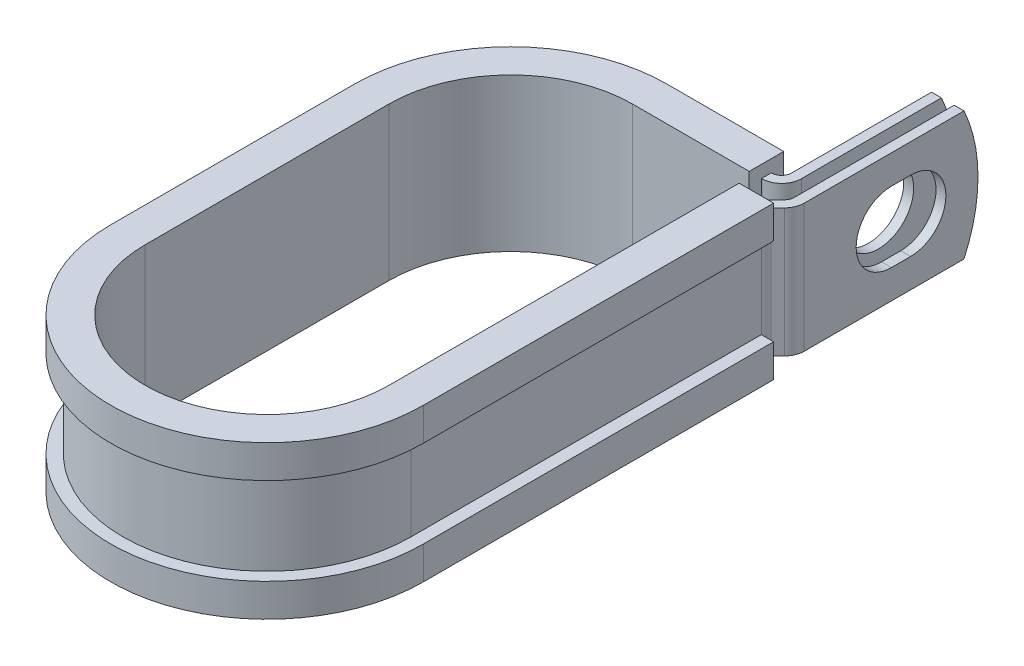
ISO-10303-21;
HEADER;
FILE_DESCRIPTION(('STEP AP214'),'2;1');
FILE_NAME('part.step','',(''),(''),'','','');
FILE_SCHEMA(('AUTOMOTIVE_DESIGN { 1 0 10303 214 1 1 1 1 }'));
ENDSEC;
DATA;
#1=APPLICATION_CONTEXT('core data for automotive mechanical design processes');
#2=APPLICATION_PROTOCOL_DEFINITION('international standard','automotive_design',2000,#1);
#3=PRODUCT_CONTEXT('',#1,'mechanical');
#4=PRODUCT('Part','Part','',(#3));
#5=PRODUCT_RELATED_PRODUCT_CATEGORY('part','',(#4));
#6=PRODUCT_DEFINITION_FORMATION('','',#4);
#7=PRODUCT_DEFINITION_CONTEXT('part definition',#1,'design');
#8=PRODUCT_DEFINITION('design','',#6,#7);
#9=PRODUCT_DEFINITION_SHAPE('','',#8);
#10=(LENGTH_UNIT() NAMED_UNIT(*) SI_UNIT(.MILLI.,.METRE.));
#11=(NAMED_UNIT(*) PLANE_ANGLE_UNIT() SI_UNIT($,.RADIAN.));
#12=(NAMED_UNIT(*) SI_UNIT($,.STERADIAN.) SOLID_ANGLE_UNIT());
#13=UNCERTAINTY_MEASURE_WITH_UNIT(LENGTH_MEASURE(1.E-05),#10,'distance_accuracy_value','');
#14=(GEOMETRIC_REPRESENTATION_CONTEXT(3) GLOBAL_UNCERTAINTY_ASSIGNED_CONTEXT((#13)) GLOBAL_UNIT_ASSIGNED_CONTEXT((#10,
#11,#12)) REPRESENTATION_CONTEXT('',''));
#15=CARTESIAN_POINT('',(0.,0.,0.));
#16=DIRECTION('',(0.,0.,1.));
#17=DIRECTION('',(1.,0.,0.));
#18=AXIS2_PLACEMENT_3D('',#15,#16,#17);
#19=CARTESIAN_POINT('',(17.2771698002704,-7.9375,-16.5989));
#20=DIRECTION('',(0.,1.,0.));
#21=DIRECTION('',(1.,0.,0.));
#22=AXIS2_PLACEMENT_3D('',#19,#20,#21);
#23=PLANE('',#22);
#24=DIRECTION('',(0.,0.,-1.));
#25=VECTOR('',#24,1.);
#26=CARTESIAN_POINT('',(14.4323698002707,-7.9375,-16.5989));
#27=LINE('',#26,#25);
#28=CARTESIAN_POINT('',(14.4323698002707,-7.9375,-16.5989));
#29=VERTEX_POINT('',#28);
#30=CARTESIAN_POINT('',(14.4323698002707,-7.9375,-17.8181));
#31=VERTEX_POINT('',#30);
#32=EDGE_CURVE('E582',#29,#31,#27,.T.);
#33=ORIENTED_EDGE('',*,*,#32,.T.);
#34=DIRECTION('',(1.,0.,0.));
#35=VECTOR('',#34,1.);
#36=CARTESIAN_POINT('',(0.,-7.9375,-17.8181));
#37=LINE('',#36,#35);
#38=CARTESIAN_POINT('',(14.4831698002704,-7.9375,-17.8181));
#39=VERTEX_POINT('',#38);
#40=EDGE_CURVE('E416',#39,#31,#37,.F.);
#41=ORIENTED_EDGE('',*,*,#40,.F.);
#42=CARTESIAN_POINT('',(14.4831698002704,-7.9375,-19.0373));
#43=DIRECTION('',(0.,1.,0.));
#44=DIRECTION('',(1.,0.,0.));
#45=AXIS2_PLACEMENT_3D('',#42,#43,#44);
#46=CIRCLE('',#45,1.2192);
#47=CARTESIAN_POINT('',(15.7023698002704,-7.9375,-19.0373));
#48=VERTEX_POINT('',#47);
#49=EDGE_CURVE('E414',#48,#39,#46,.F.);
#50=ORIENTED_EDGE('',*,*,#49,.F.);
#51=DIRECTION('',(0.,0.,1.));
#52=VECTOR('',#51,1.);
#53=CARTESIAN_POINT('',(15.7023698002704,-7.9375,-38.1));
#54=LINE('',#53,#52);
#55=CARTESIAN_POINT('',(15.7023698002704,-7.9375,-36.3675804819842));
#56=VERTEX_POINT('',#55);
#57=EDGE_CURVE('E412',#56,#48,#54,.T.);
#58=ORIENTED_EDGE('',*,*,#57,.F.);
#59=DIRECTION('',(-1.,0.,0.));
#60=VECTOR('',#59,1.);
#61=CARTESIAN_POINT('',(19.7155698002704,-7.9375,-36.3675804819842));
#62=LINE('',#61,#60);
#63=CARTESIAN_POINT('',(16.9215698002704,-7.9375,-36.3675804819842));
#64=VERTEX_POINT('',#63);
#65=EDGE_CURVE('E12',#64,#56,#62,.T.);
#66=ORIENTED_EDGE('',*,*,#65,.F.);
#67=DIRECTION('',(0.,0.,1.));
#68=VECTOR('',#67,1.);
#69=CARTESIAN_POINT('',(16.9215698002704,-7.9375,-38.1));
#70=LINE('',#69,#68);
#71=CARTESIAN_POINT('',(16.9215698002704,-7.9375,-19.0373));
#72=VERTEX_POINT('',#71);
#73=EDGE_CURVE('E410',#64,#72,#70,.T.);
#74=ORIENTED_EDGE('',*,*,#73,.T.);
#75=CARTESIAN_POINT('',(14.4831698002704,-7.9375,-19.0373));
#76=DIRECTION('',(0.,-1.,0.));
#77=DIRECTION('',(0.,0.,1.));
#78=AXIS2_PLACEMENT_3D('',#75,#76,#77);
#79=CIRCLE('',#78,2.4384);
#80=CARTESIAN_POINT('',(14.4831698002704,-7.9375,-16.5989));
#81=VERTEX_POINT('',#80);
#82=EDGE_CURVE('E407',#72,#81,#79,.T.);
#83=ORIENTED_EDGE('',*,*,#82,.T.);
#84=DIRECTION('',(-1.,0.,0.));
#85=VECTOR('',#84,1.);
#86=CARTESIAN_POINT('',(0.,-7.9375,-16.5989));
#87=LINE('',#86,#85);
#88=EDGE_CURVE('E404',#81,#29,#87,.T.);
#89=ORIENTED_EDGE('',*,*,#88,.T.);
#90=EDGE_LOOP('',(#33,#41,#50,#58,#66,#74,#83,#89));
#91=FACE_BOUND('',#90,.T.);
#92=ADVANCED_FACE('F55',(#91),#23,.F.);
#93=CARTESIAN_POINT('',(17.2771698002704,7.9375,-16.5989));
#94=DIRECTION('',(0.,1.,0.));
#95=DIRECTION('',(1.,0.,0.));
#96=AXIS2_PLACEMENT_3D('',#93,#94,#95);
#97=PLANE('',#96);
#98=DIRECTION('',(1.,0.,0.));
#99=VECTOR('',#98,1.);
#100=CARTESIAN_POINT('',(0.,7.9375,-17.8181));
#101=LINE('',#100,#99);
#102=CARTESIAN_POINT('',(14.4831698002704,7.9375,-17.8181));
#103=VERTEX_POINT('',#102);
#104=CARTESIAN_POINT('',(14.4323698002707,7.9375,-17.8181));
#105=VERTEX_POINT('',#104);
#106=EDGE_CURVE('E377',#103,#105,#101,.F.);
#107=ORIENTED_EDGE('',*,*,#106,.T.);
#108=DIRECTION('',(0.,0.,1.));
#109=VECTOR('',#108,1.);
#110=CARTESIAN_POINT('',(14.4323698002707,7.9375,-17.8181));
#111=LINE('',#110,#109);
#112=CARTESIAN_POINT('',(14.4323698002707,7.9375,-16.5989));
#113=VERTEX_POINT('',#112);
#114=EDGE_CURVE('E588',#105,#113,#111,.T.);
#115=ORIENTED_EDGE('',*,*,#114,.T.);
#116=DIRECTION('',(-1.,0.,0.));
#117=VECTOR('',#116,1.);
#118=CARTESIAN_POINT('',(0.,7.9375,-16.5989));
#119=LINE('',#118,#117);
#120=CARTESIAN_POINT('',(14.4831698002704,7.9375,-16.5989));
#121=VERTEX_POINT('',#120);
#122=EDGE_CURVE('E479',#121,#113,#119,.T.);
#123=ORIENTED_EDGE('',*,*,#122,.F.);
#124=CARTESIAN_POINT('',(14.4831698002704,7.9375,-19.0373));
#125=DIRECTION('',(0.,-1.,0.));
#126=DIRECTION('',(0.,0.,1.));
#127=AXIS2_PLACEMENT_3D('',#124,#125,#126);
#128=CIRCLE('',#127,2.4384);
#129=CARTESIAN_POINT('',(16.9215698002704,7.9375,-19.0373));
#130=VERTEX_POINT('',#129);
#131=EDGE_CURVE('E474',#130,#121,#128,.T.);
#132=ORIENTED_EDGE('',*,*,#131,.F.);
#133=DIRECTION('',(0.,0.,1.));
#134=VECTOR('',#133,1.);
#135=CARTESIAN_POINT('',(16.9215698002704,7.9375,-38.1));
#136=LINE('',#135,#134);
#137=CARTESIAN_POINT('',(16.9215698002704,7.9375,-36.3675804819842));
#138=VERTEX_POINT('',#137);
#139=EDGE_CURVE('E468',#138,#130,#136,.T.);
#140=ORIENTED_EDGE('',*,*,#139,.F.);
#141=DIRECTION('',(-1.,0.,0.));
#142=VECTOR('',#141,1.);
#143=CARTESIAN_POINT('',(19.7155698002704,7.9375,-36.3675804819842));
#144=LINE('',#143,#142);
#145=CARTESIAN_POINT('',(15.7023698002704,7.9375,-36.3675804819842));
#146=VERTEX_POINT('',#145);
#147=EDGE_CURVE('E63',#138,#146,#144,.T.);
#148=ORIENTED_EDGE('',*,*,#147,.T.);
#149=DIRECTION('',(0.,0.,1.));
#150=VECTOR('',#149,1.);
#151=CARTESIAN_POINT('',(15.7023698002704,7.9375,-38.1));
#152=LINE('',#151,#150);
#153=CARTESIAN_POINT('',(15.7023698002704,7.9375,-19.0373));
#154=VERTEX_POINT('',#153);
#155=EDGE_CURVE('E465',#146,#154,#152,.T.);
#156=ORIENTED_EDGE('',*,*,#155,.T.);
#157=CARTESIAN_POINT('',(14.4831698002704,7.9375,-19.0373));
#158=DIRECTION('',(0.,1.,0.));
#159=DIRECTION('',(1.,0.,0.));
#160=AXIS2_PLACEMENT_3D('',#157,#158,#159);
#161=CIRCLE('',#160,1.2192);
#162=EDGE_CURVE('E382',#154,#103,#161,.F.);
#163=ORIENTED_EDGE('',*,*,#162,.T.);
#164=EDGE_LOOP('',(#107,#115,#123,#132,#140,#148,#156,#163));
#165=FACE_BOUND('',#164,.T.);
#166=ADVANCED_FACE('F464',(#165),#97,.T.);
#167=CARTESIAN_POINT('',(0.,7.9375,-16.5989));
#168=DIRECTION('',(0.,0.,1.));
#169=DIRECTION('',(1.,0.,0.));
#170=AXIS2_PLACEMENT_3D('',#167,#168,#169);
#171=PLANE('',#170);
#172=ORIENTED_EDGE('',*,*,#122,.T.);
#173=DIRECTION('',(0.,-1.,0.));
#174=VECTOR('',#173,1.);
#175=CARTESIAN_POINT('',(14.4323698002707,7.9375,-16.5989));
#176=LINE('',#175,#174);
#177=EDGE_CURVE('E585',#113,#29,#176,.T.);
#178=ORIENTED_EDGE('',*,*,#177,.T.);
#179=ORIENTED_EDGE('',*,*,#88,.F.);
#180=DIRECTION('',(0.,-1.,0.));
#181=VECTOR('',#180,1.);
#182=CARTESIAN_POINT('',(14.4831698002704,7.9375,-16.5989));
#183=LINE('',#182,#181);
#184=EDGE_CURVE('E452',#121,#81,#183,.T.);
#185=ORIENTED_EDGE('',*,*,#184,.F.);
#186=EDGE_LOOP('',(#172,#178,#179,#185));
#187=FACE_BOUND('',#186,.T.);
#188=ADVANCED_FACE('F789',(#187),#171,.T.);
#189=CARTESIAN_POINT('',(19.7155698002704,7.9375,-16.5989));
#190=DIRECTION('',(-1.,0.,0.));
#191=DIRECTION('',(0.,0.,1.));
#192=AXIS2_PLACEMENT_3D('',#189,#190,#191);
#193=PLANE('',#192);
#194=CARTESIAN_POINT('',(19.7155698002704,0.,-29.7687999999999));
#195=DIRECTION('',(1.,0.,0.));
#196=DIRECTION('',(0.,0.,-1.));
#197=AXIS2_PLACEMENT_3D('',#194,#195,#196);
#198=CIRCLE('',#197,4.3561);
#199=CARTESIAN_POINT('',(19.7155698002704,-4.3561,-29.7688000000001));
#200=VERTEX_POINT('',#199);
#201=CARTESIAN_POINT('',(19.7155698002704,4.3561,-29.7688000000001));
#202=VERTEX_POINT('',#201);
#203=EDGE_CURVE('E527',#200,#202,#198,.T.);
#204=ORIENTED_EDGE('',*,*,#203,.F.);
#205=DIRECTION('',(0.,0.,-1.));
#206=VECTOR('',#205,1.);
#207=CARTESIAN_POINT('',(19.7155698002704,-4.3561,-27.3811999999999));
#208=LINE('',#207,#206);
#209=CARTESIAN_POINT('',(19.7155698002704,-4.3561,-27.3811999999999));
#210=VERTEX_POINT('',#209);
#211=EDGE_CURVE('E524',#210,#200,#208,.T.);
#212=ORIENTED_EDGE('',*,*,#211,.F.);
#213=CARTESIAN_POINT('',(19.7155698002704,0.,-27.3811999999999));
#214=DIRECTION('',(1.,0.,0.));
#215=DIRECTION('',(0.,0.,-1.));
#216=AXIS2_PLACEMENT_3D('',#213,#214,#215);
#217=CIRCLE('',#216,4.3561);
#218=CARTESIAN_POINT('',(19.7155698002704,4.3561,-27.3811999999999));
#219=VERTEX_POINT('',#218);
#220=EDGE_CURVE('E521',#219,#210,#217,.T.);
#221=ORIENTED_EDGE('',*,*,#220,.F.);
#222=DIRECTION('',(0.,0.,1.));
#223=VECTOR('',#222,1.);
#224=CARTESIAN_POINT('',(19.7155698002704,4.3561,-27.3811999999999));
#225=LINE('',#224,#223);
#226=EDGE_CURVE('E520',#202,#219,#225,.T.);
#227=ORIENTED_EDGE('',*,*,#226,.F.);
#228=EDGE_LOOP('',(#204,#212,#221,#227));
#229=FACE_BOUND('',#228,.T.);
#230=DIRECTION('',(0.,0.,-1.));
#231=VECTOR('',#230,1.);
#232=CARTESIAN_POINT('',(19.7155698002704,-7.9375,-16.5989));
#233=LINE('',#232,#231);
#234=CARTESIAN_POINT('',(19.7155698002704,-7.9375,-16.5989));
#235=VERTEX_POINT('',#234);
#236=CARTESIAN_POINT('',(19.7155698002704,-7.9375,-36.3675804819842));
#237=VERTEX_POINT('',#236);
#238=EDGE_CURVE('E388',#235,#237,#233,.T.);
#239=ORIENTED_EDGE('',*,*,#238,.T.);
#240=CARTESIAN_POINT('',(19.7155698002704,0.,-19.05));
#241=DIRECTION('',(-1.,0.,0.));
#242=DIRECTION('',(0.,0.,1.));
#243=AXIS2_PLACEMENT_3D('',#240,#241,#242);
#244=CIRCLE('',#243,19.05);
#245=CARTESIAN_POINT('',(19.7155698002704,7.9375,-36.3675804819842));
#246=VERTEX_POINT('',#245);
#247=EDGE_CURVE('E536',#246,#237,#244,.T.);
#248=ORIENTED_EDGE('',*,*,#247,.F.);
#249=DIRECTION('',(0.,0.,-1.));
#250=VECTOR('',#249,1.);
#251=CARTESIAN_POINT('',(19.7155698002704,7.9375,-16.5989));
#252=LINE('',#251,#250);
#253=CARTESIAN_POINT('',(19.7155698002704,7.9375,-16.5989));
#254=VERTEX_POINT('',#253);
#255=EDGE_CURVE('E425',#254,#246,#252,.T.);
#256=ORIENTED_EDGE('',*,*,#255,.F.);
#257=DIRECTION('',(0.,-1.,0.));
#258=VECTOR('',#257,1.);
#259=CARTESIAN_POINT('',(19.7155698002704,7.9375,-16.5989));
#260=LINE('',#259,#258);
#261=EDGE_CURVE('E387',#254,#235,#260,.T.);
#262=ORIENTED_EDGE('',*,*,#261,.T.);
#263=EDGE_LOOP('',(#239,#248,#256,#262));
#264=FACE_BOUND('',#263,.T.);
#265=ADVANCED_FACE('F57',(#229,#264),#193,.F.);
#266=CARTESIAN_POINT('',(18.4963698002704,7.9375,-16.5989));
#267=DIRECTION('',(-1.,0.,0.));
#268=DIRECTION('',(0.,0.,1.));
#269=AXIS2_PLACEMENT_3D('',#266,#267,#268);
#270=PLANE('',#269);
#271=DIRECTION('',(0.,0.,-1.));
#272=VECTOR('',#271,1.);
#273=CARTESIAN_POINT('',(18.4963698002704,-4.3561,-27.3811999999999));
#274=LINE('',#273,#272);
#275=CARTESIAN_POINT('',(18.4963698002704,-4.3561,-27.3811999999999));
#276=VERTEX_POINT('',#275);
#277=CARTESIAN_POINT('',(18.4963698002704,-4.3561,-29.7688000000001));
#278=VERTEX_POINT('',#277);
#279=EDGE_CURVE('E505',#276,#278,#274,.T.);
#280=ORIENTED_EDGE('',*,*,#279,.T.);
#281=CARTESIAN_POINT('',(18.4963698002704,0.,-29.7687999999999));
#282=DIRECTION('',(-1.,0.,0.));
#283=DIRECTION('',(0.,0.,1.));
#284=AXIS2_PLACEMENT_3D('',#281,#282,#283);
#285=CIRCLE('',#284,4.3561);
#286=CARTESIAN_POINT('',(18.4963698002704,4.3561,-29.7688000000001));
#287=VERTEX_POINT('',#286);
#288=EDGE_CURVE('E504',#278,#287,#285,.F.);
#289=ORIENTED_EDGE('',*,*,#288,.T.);
#290=DIRECTION('',(0.,0.,1.));
#291=VECTOR('',#290,1.);
#292=CARTESIAN_POINT('',(18.4963698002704,4.3561,-27.3811999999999));
#293=LINE('',#292,#291);
#294=CARTESIAN_POINT('',(18.4963698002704,4.3561,-27.3811999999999));
#295=VERTEX_POINT('',#294);
#296=EDGE_CURVE('E508',#287,#295,#293,.T.);
#297=ORIENTED_EDGE('',*,*,#296,.T.);
#298=CARTESIAN_POINT('',(18.4963698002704,0.,-27.3811999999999));
#299=DIRECTION('',(-1.,0.,0.));
#300=DIRECTION('',(0.,0.,1.));
#301=AXIS2_PLACEMENT_3D('',#298,#299,#300);
#302=CIRCLE('',#301,4.3561);
#303=EDGE_CURVE('E501',#295,#276,#302,.F.);
#304=ORIENTED_EDGE('',*,*,#303,.T.);
#305=EDGE_LOOP('',(#280,#289,#297,#304));
#306=FACE_BOUND('',#305,.T.);
#307=CARTESIAN_POINT('',(18.4963698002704,0.,-19.05));
#308=DIRECTION('',(-1.,0.,0.));
#309=DIRECTION('',(0.,0.,1.));
#310=AXIS2_PLACEMENT_3D('',#307,#308,#309);
#311=CIRCLE('',#310,19.05);
#312=CARTESIAN_POINT('',(18.4963698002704,7.9375,-36.3675804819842));
#313=VERTEX_POINT('',#312);
#314=CARTESIAN_POINT('',(18.4963698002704,-7.9375,-36.3675804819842));
#315=VERTEX_POINT('',#314);
#316=EDGE_CURVE('E77',#313,#315,#311,.T.);
#317=ORIENTED_EDGE('',*,*,#316,.T.);
#318=DIRECTION('',(0.,0.,-1.));
#319=VECTOR('',#318,1.);
#320=CARTESIAN_POINT('',(18.4963698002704,-7.9375,-16.5989));
#321=LINE('',#320,#319);
#322=CARTESIAN_POINT('',(18.4963698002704,-7.9375,-16.5989));
#323=VERTEX_POINT('',#322);
#324=EDGE_CURVE('E391',#323,#315,#321,.T.);
#325=ORIENTED_EDGE('',*,*,#324,.F.);
#326=DIRECTION('',(0.,-1.,0.));
#327=VECTOR('',#326,1.);
#328=CARTESIAN_POINT('',(18.4963698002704,7.9375,-16.5989));
#329=LINE('',#328,#327);
#330=CARTESIAN_POINT('',(18.4963698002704,7.9375,-16.5989));
#331=VERTEX_POINT('',#330);
#332=EDGE_CURVE('E460',#331,#323,#329,.T.);
#333=ORIENTED_EDGE('',*,*,#332,.F.);
#334=DIRECTION('',(0.,0.,-1.));
#335=VECTOR('',#334,1.);
#336=CARTESIAN_POINT('',(18.4963698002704,7.9375,-16.5989));
#337=LINE('',#336,#335);
#338=EDGE_CURVE('E489',#331,#313,#337,.T.);
#339=ORIENTED_EDGE('',*,*,#338,.T.);
#340=EDGE_LOOP('',(#317,#325,#333,#339));
#341=FACE_BOUND('',#340,.T.);
#342=ADVANCED_FACE('F762',(#306,#341),#270,.T.);
#343=CARTESIAN_POINT('',(16.9215698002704,7.9375,-38.1));
#344=DIRECTION('',(1.,0.,0.));
#345=DIRECTION('',(0.,0.,-1.));
#346=AXIS2_PLACEMENT_3D('',#343,#344,#345);
#347=PLANE('',#346);
#348=CARTESIAN_POINT('',(16.9215698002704,0.,-28.575));
#349=DIRECTION('',(1.,0.,0.));
#350=DIRECTION('',(0.,0.,-1.));
#351=AXIS2_PLACEMENT_3D('',#348,#349,#350);
#352=CIRCLE('',#351,4.3561);
#353=CARTESIAN_POINT('',(16.9215698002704,0.,-32.9311));
#354=VERTEX_POINT('',#353);
#355=EDGE_CURVE('E392',#354,#354,#352,.F.);
#356=ORIENTED_EDGE('',*,*,#355,.T.);
#357=EDGE_LOOP('',(#356));
#358=FACE_BOUND('',#357,.T.);
#359=ORIENTED_EDGE('',*,*,#73,.F.);
#360=CARTESIAN_POINT('',(16.9215698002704,0.,-19.05));
#361=DIRECTION('',(1.,0.,0.));
#362=DIRECTION('',(0.,0.,-1.));
#363=AXIS2_PLACEMENT_3D('',#360,#361,#362);
#364=CIRCLE('',#363,19.05);
#365=EDGE_CURVE('E532',#64,#138,#364,.T.);
#366=ORIENTED_EDGE('',*,*,#365,.T.);
#367=ORIENTED_EDGE('',*,*,#139,.T.);
#368=DIRECTION('',(0.,-1.,0.));
#369=VECTOR('',#368,1.);
#370=CARTESIAN_POINT('',(16.9215698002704,7.9375,-19.0373));
#371=LINE('',#370,#369);
#372=EDGE_CURVE('E449',#130,#72,#371,.T.);
#373=ORIENTED_EDGE('',*,*,#372,.T.);
#374=EDGE_LOOP('',(#359,#366,#367,#373));
#375=FACE_BOUND('',#374,.T.);
#376=ADVANCED_FACE('F797',(#358,#375),#347,.T.);
#377=CARTESIAN_POINT('',(15.7023698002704,7.9375,-38.1));
#378=DIRECTION('',(1.,0.,0.));
#379=DIRECTION('',(0.,0.,-1.));
#380=AXIS2_PLACEMENT_3D('',#377,#378,#379);
#381=PLANE('',#380);
#382=CARTESIAN_POINT('',(15.7023698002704,0.,-28.575));
#383=DIRECTION('',(-1.,0.,0.));
#384=DIRECTION('',(0.,0.,1.));
#385=AXIS2_PLACEMENT_3D('',#382,#383,#384);
#386=CIRCLE('',#385,4.3561);
#387=CARTESIAN_POINT('',(15.7023698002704,0.,-24.2189));
#388=VERTEX_POINT('',#387);
#389=EDGE_CURVE('E496',#388,#388,#386,.T.);
#390=ORIENTED_EDGE('',*,*,#389,.F.);
#391=EDGE_LOOP('',(#390));
#392=FACE_BOUND('',#391,.T.);
#393=CARTESIAN_POINT('',(15.7023698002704,0.,-19.05));
#394=DIRECTION('',(-1.,0.,0.));
#395=DIRECTION('',(0.,0.,1.));
#396=AXIS2_PLACEMENT_3D('',#393,#394,#395);
#397=CIRCLE('',#396,19.05);
#398=EDGE_CURVE('E69',#146,#56,#397,.T.);
#399=ORIENTED_EDGE('',*,*,#398,.T.);
#400=ORIENTED_EDGE('',*,*,#57,.T.);
#401=DIRECTION('',(0.,-1.,0.));
#402=VECTOR('',#401,1.);
#403=CARTESIAN_POINT('',(15.7023698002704,7.9375,-19.0373));
#404=LINE('',#403,#402);
#405=EDGE_CURVE('E446',#154,#48,#404,.T.);
#406=ORIENTED_EDGE('',*,*,#405,.F.);
#407=ORIENTED_EDGE('',*,*,#155,.F.);
#408=EDGE_LOOP('',(#399,#400,#406,#407));
#409=FACE_BOUND('',#408,.T.);
#410=ADVANCED_FACE('F471',(#392,#409),#381,.F.);
#411=CARTESIAN_POINT('',(19.0373,-7.9375,-13.1864026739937));
#412=DIRECTION('',(0.,1.,0.));
#413=DIRECTION('',(1.,0.,0.));
#414=AXIS2_PLACEMENT_3D('',#411,#412,#413);
#415=CIRCLE('',#414,1.2192);
#416=CARTESIAN_POINT('',(17.8181,-7.9375,-13.1864026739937));
#417=VERTEX_POINT('',#416);
#418=CARTESIAN_POINT('',(18.1751954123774,-7.9375,-14.0485072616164));
#419=VERTEX_POINT('',#418);
#420=EDGE_CURVE('E419',#417,#419,#415,.F.);
#421=ORIENTED_EDGE('',*,*,#420,.F.);
#422=DIRECTION('',(1.,0.,0.));
#423=VECTOR('',#422,1.);
#424=CARTESIAN_POINT('',(16.5989,-7.9375,-13.1864026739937));
#425=LINE('',#424,#423);
#426=CARTESIAN_POINT('',(16.5989,-7.9375,-13.1864026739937));
#427=VERTEX_POINT('',#426);
#428=EDGE_CURVE('E370',#427,#417,#425,.T.);
#429=ORIENTED_EDGE('',*,*,#428,.F.);
#430=CARTESIAN_POINT('',(19.0373,-7.9375,-13.1864026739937));
#431=DIRECTION('',(0.,-1.,0.));
#432=DIRECTION('',(0.,0.,1.));
#433=AXIS2_PLACEMENT_3D('',#430,#431,#432);
#434=CIRCLE('',#433,2.4384);
#435=CARTESIAN_POINT('',(17.3130908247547,-7.9375,-14.910611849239));
#436=VERTEX_POINT('',#435);
#437=EDGE_CURVE('E401',#427,#436,#434,.T.);
#438=ORIENTED_EDGE('',*,*,#437,.T.);
#439=DIRECTION('',(0.707106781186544,0.,-0.707106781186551));
#440=VECTOR('',#439,1.);
#441=CARTESIAN_POINT('',(17.3130908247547,-7.9375,-14.910611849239));
#442=LINE('',#441,#440);
#443=CARTESIAN_POINT('',(18.1392743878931,-7.9375,-15.7367954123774));
#444=VERTEX_POINT('',#443);
#445=EDGE_CURVE('E398',#436,#444,#442,.T.);
#446=ORIENTED_EDGE('',*,*,#445,.T.);
#447=CARTESIAN_POINT('',(17.2771698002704,-7.9375,-16.5989));
#448=DIRECTION('',(0.,1.,0.));
#449=DIRECTION('',(0.,0.,1.));
#450=AXIS2_PLACEMENT_3D('',#447,#448,#449);
#451=CIRCLE('',#450,1.2192);
#452=EDGE_CURVE('E395',#444,#323,#451,.T.);
#453=ORIENTED_EDGE('',*,*,#452,.T.);
#454=ORIENTED_EDGE('',*,*,#324,.T.);
#455=DIRECTION('',(-1.,0.,0.));
#456=VECTOR('',#455,1.);
#457=CARTESIAN_POINT('',(19.7155698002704,-7.9375,-36.3675804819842));
#458=LINE('',#457,#456);
#459=EDGE_CURVE('E538',#237,#315,#458,.T.);
#460=ORIENTED_EDGE('',*,*,#459,.F.);
#461=ORIENTED_EDGE('',*,*,#238,.F.);
#462=CARTESIAN_POINT('',(17.2771698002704,-7.9375,-16.5989));
#463=DIRECTION('',(0.,1.,0.));
#464=DIRECTION('',(1.,0.,0.));
#465=AXIS2_PLACEMENT_3D('',#462,#463,#464);
#466=CIRCLE('',#465,2.4384);
#467=CARTESIAN_POINT('',(19.0013789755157,-7.9375,-14.8746908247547));
#468=VERTEX_POINT('',#467);
#469=EDGE_CURVE('E423',#468,#235,#466,.T.);
#470=ORIENTED_EDGE('',*,*,#469,.F.);
#471=DIRECTION('',(0.707106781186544,0.,-0.707106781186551));
#472=VECTOR('',#471,1.);
#473=CARTESIAN_POINT('',(18.1751954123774,-7.9375,-14.0485072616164));
#474=LINE('',#473,#472);
#475=EDGE_CURVE('E421',#419,#468,#474,.T.);
#476=ORIENTED_EDGE('',*,*,#475,.F.);
#477=EDGE_LOOP('',(#421,#429,#438,#446,#453,#454,#460,#461,#470,#476));
#478=FACE_BOUND('',#477,.T.);
#479=ADVANCED_FACE('F743',(#478),#23,.F.);
#480=DIRECTION('',(-1.,0.,0.));
#481=VECTOR('',#480,1.);
#482=CARTESIAN_POINT('',(17.8181,7.9375,-13.1864026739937));
#483=LINE('',#482,#481);
#484=CARTESIAN_POINT('',(17.8181,7.9375,-13.1864026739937));
#485=VERTEX_POINT('',#484);
#486=CARTESIAN_POINT('',(16.5989,7.9375,-13.1864026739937));
#487=VERTEX_POINT('',#486);
#488=EDGE_CURVE('E350',#485,#487,#483,.T.);
#489=ORIENTED_EDGE('',*,*,#488,.F.);
#490=CARTESIAN_POINT('',(19.0373,7.9375,-13.1864026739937));
#491=DIRECTION('',(0.,1.,0.));
#492=DIRECTION('',(1.,0.,0.));
#493=AXIS2_PLACEMENT_3D('',#490,#491,#492);
#494=CIRCLE('',#493,1.2192);
#495=CARTESIAN_POINT('',(18.1751954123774,7.9375,-14.0485072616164));
#496=VERTEX_POINT('',#495);
#497=EDGE_CURVE('E365',#485,#496,#494,.F.);
#498=ORIENTED_EDGE('',*,*,#497,.T.);
#499=DIRECTION('',(0.707106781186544,0.,-0.707106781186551));
#500=VECTOR('',#499,1.);
#501=CARTESIAN_POINT('',(18.1751954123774,7.9375,-14.0485072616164));
#502=LINE('',#501,#500);
#503=CARTESIAN_POINT('',(19.0013789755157,7.9375,-14.8746908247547));
#504=VERTEX_POINT('',#503);
#505=EDGE_CURVE('E376',#496,#504,#502,.T.);
#506=ORIENTED_EDGE('',*,*,#505,.T.);
#507=CARTESIAN_POINT('',(17.2771698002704,7.9375,-16.5989));
#508=DIRECTION('',(0.,1.,0.));
#509=DIRECTION('',(1.,0.,0.));
#510=AXIS2_PLACEMENT_3D('',#507,#508,#509);
#511=CIRCLE('',#510,2.4384);
#512=EDGE_CURVE('E379',#504,#254,#511,.T.);
#513=ORIENTED_EDGE('',*,*,#512,.T.);
#514=ORIENTED_EDGE('',*,*,#255,.T.);
#515=DIRECTION('',(-1.,0.,0.));
#516=VECTOR('',#515,1.);
#517=CARTESIAN_POINT('',(19.7155698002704,7.9375,-36.3675804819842));
#518=LINE('',#517,#516);
#519=EDGE_CURVE('E534',#246,#313,#518,.T.);
#520=ORIENTED_EDGE('',*,*,#519,.T.);
#521=ORIENTED_EDGE('',*,*,#338,.F.);
#522=CARTESIAN_POINT('',(17.2771698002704,7.9375,-16.5989));
#523=DIRECTION('',(0.,1.,0.));
#524=DIRECTION('',(0.,0.,1.));
#525=AXIS2_PLACEMENT_3D('',#522,#523,#524);
#526=CIRCLE('',#525,1.2192);
#527=CARTESIAN_POINT('',(18.1392743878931,7.9375,-15.7367954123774));
#528=VERTEX_POINT('',#527);
#529=EDGE_CURVE('E486',#528,#331,#526,.T.);
#530=ORIENTED_EDGE('',*,*,#529,.F.);
#531=DIRECTION('',(0.707106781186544,0.,-0.707106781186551));
#532=VECTOR('',#531,1.);
#533=CARTESIAN_POINT('',(17.3130908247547,7.9375,-14.910611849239));
#534=LINE('',#533,#532);
#535=CARTESIAN_POINT('',(17.3130908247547,7.9375,-14.910611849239));
#536=VERTEX_POINT('',#535);
#537=EDGE_CURVE('E483',#536,#528,#534,.T.);
#538=ORIENTED_EDGE('',*,*,#537,.F.);
#539=CARTESIAN_POINT('',(19.0373,7.9375,-13.1864026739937));
#540=DIRECTION('',(0.,-1.,0.));
#541=DIRECTION('',(0.,0.,1.));
#542=AXIS2_PLACEMENT_3D('',#539,#540,#541);
#543=CIRCLE('',#542,2.4384);
#544=EDGE_CURVE('E369',#487,#536,#543,.T.);
#545=ORIENTED_EDGE('',*,*,#544,.F.);
#546=EDGE_LOOP('',(#489,#498,#506,#513,#514,#520,#521,#530,#538,#545));
#547=FACE_BOUND('',#546,.T.);
#548=ADVANCED_FACE('F364',(#547),#97,.T.);
#549=CARTESIAN_POINT('',(17.2771698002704,7.9375,-16.5989));
#550=DIRECTION('',(0.,-1.,0.));
#551=DIRECTION('',(0.,0.,-1.));
#552=AXIS2_PLACEMENT_3D('',#549,#550,#551);
#553=CYLINDRICAL_SURFACE('',#552,1.2192);
#554=ORIENTED_EDGE('',*,*,#452,.F.);
#555=DIRECTION('',(0.,-1.,0.));
#556=VECTOR('',#555,1.);
#557=CARTESIAN_POINT('',(18.1392743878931,7.9375,-15.7367954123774));
#558=LINE('',#557,#556);
#559=EDGE_CURVE('E458',#528,#444,#558,.T.);
#560=ORIENTED_EDGE('',*,*,#559,.F.);
#561=ORIENTED_EDGE('',*,*,#529,.T.);
#562=ORIENTED_EDGE('',*,*,#332,.T.);
#563=EDGE_LOOP('',(#554,#560,#561,#562));
#564=FACE_BOUND('',#563,.T.);
#565=ADVANCED_FACE('F765',(#564),#553,.F.);
#566=CARTESIAN_POINT('',(17.3130908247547,7.9375,-14.910611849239));
#567=DIRECTION('',(-0.707106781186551,0.,-0.707106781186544));
#568=DIRECTION('',(-0.707106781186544,0.,0.707106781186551));
#569=AXIS2_PLACEMENT_3D('',#566,#567,#568);
#570=PLANE('',#569);
#571=ORIENTED_EDGE('',*,*,#445,.F.);
#572=DIRECTION('',(0.,-1.,0.));
#573=VECTOR('',#572,1.);
#574=CARTESIAN_POINT('',(17.3130908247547,7.9375,-14.910611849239));
#575=LINE('',#574,#573);
#576=EDGE_CURVE('E456',#536,#436,#575,.T.);
#577=ORIENTED_EDGE('',*,*,#576,.F.);
#578=ORIENTED_EDGE('',*,*,#537,.T.);
#579=ORIENTED_EDGE('',*,*,#559,.T.);
#580=EDGE_LOOP('',(#571,#577,#578,#579));
#581=FACE_BOUND('',#580,.T.);
#582=ADVANCED_FACE('F768',(#581),#570,.T.);
#583=CARTESIAN_POINT('',(19.0373,7.9375,-13.1864026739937));
#584=DIRECTION('',(0.,-1.,0.));
#585=DIRECTION('',(0.,0.,-1.));
#586=AXIS2_PLACEMENT_3D('',#583,#584,#585);
#587=CYLINDRICAL_SURFACE('',#586,2.4384);
#588=ORIENTED_EDGE('',*,*,#437,.F.);
#589=DIRECTION('',(0.,-1.,0.));
#590=VECTOR('',#589,1.);
#591=CARTESIAN_POINT('',(16.5989,7.9375,-13.1864026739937));
#592=LINE('',#591,#590);
#593=EDGE_CURVE('E454',#487,#427,#592,.T.);
#594=ORIENTED_EDGE('',*,*,#593,.F.);
#595=ORIENTED_EDGE('',*,*,#544,.T.);
#596=ORIENTED_EDGE('',*,*,#576,.T.);
#597=EDGE_LOOP('',(#588,#594,#595,#596));
#598=FACE_BOUND('',#597,.T.);
#599=ADVANCED_FACE('F770',(#598),#587,.T.);
#600=CARTESIAN_POINT('',(14.4831698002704,7.9375,-19.0373));
#601=DIRECTION('',(0.,-1.,0.));
#602=DIRECTION('',(0.,0.,-1.));
#603=AXIS2_PLACEMENT_3D('',#600,#601,#602);
#604=CYLINDRICAL_SURFACE('',#603,2.4384);
#605=ORIENTED_EDGE('',*,*,#82,.F.);
#606=ORIENTED_EDGE('',*,*,#372,.F.);
#607=ORIENTED_EDGE('',*,*,#131,.T.);
#608=ORIENTED_EDGE('',*,*,#184,.T.);
#609=EDGE_LOOP('',(#605,#606,#607,#608));
#610=FACE_BOUND('',#609,.T.);
#611=ADVANCED_FACE('F772',(#610),#604,.T.);
#612=CARTESIAN_POINT('',(14.4831698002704,7.9375,-19.0373));
#613=DIRECTION('',(0.,-1.,0.));
#614=DIRECTION('',(0.,0.,-1.));
#615=AXIS2_PLACEMENT_3D('',#612,#613,#614);
#616=CYLINDRICAL_SURFACE('',#615,1.2192);
#617=ORIENTED_EDGE('',*,*,#49,.T.);
#618=DIRECTION('',(0.,-1.,0.));
#619=VECTOR('',#618,1.);
#620=CARTESIAN_POINT('',(14.4831698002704,7.9375,-17.8181));
#621=LINE('',#620,#619);
#622=EDGE_CURVE('E443',#103,#39,#621,.T.);
#623=ORIENTED_EDGE('',*,*,#622,.F.);
#624=ORIENTED_EDGE('',*,*,#162,.F.);
#625=ORIENTED_EDGE('',*,*,#405,.T.);
#626=EDGE_LOOP('',(#617,#623,#624,#625));
#627=FACE_BOUND('',#626,.T.);
#628=ADVANCED_FACE('F778',(#627),#616,.F.);
#629=CARTESIAN_POINT('',(0.,7.9375,-17.8181));
#630=DIRECTION('',(0.,0.,1.));
#631=DIRECTION('',(1.,0.,0.));
#632=AXIS2_PLACEMENT_3D('',#629,#630,#631);
#633=PLANE('',#632);
#634=DIRECTION('',(0.,-1.,0.));
#635=VECTOR('',#634,1.);
#636=CARTESIAN_POINT('',(0.,7.9375,-17.8181));
#637=LINE('',#636,#635);
#638=CARTESIAN_POINT('',(2.49196102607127E-13,5.3975,-17.8181));
#639=VERTEX_POINT('',#638);
#640=CARTESIAN_POINT('',(2.49196102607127E-13,-5.3975,-17.8181));
#641=VERTEX_POINT('',#640);
#642=EDGE_CURVE('E440',#639,#641,#637,.T.);
#643=ORIENTED_EDGE('',*,*,#642,.F.);
#644=DIRECTION('',(1.,0.,0.));
#645=VECTOR('',#644,1.);
#646=CARTESIAN_POINT('',(2.49196102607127E-13,5.3975,-17.8181));
#647=LINE('',#646,#645);
#648=CARTESIAN_POINT('',(14.4323698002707,5.3975,-17.8181));
#649=VERTEX_POINT('',#648);
#650=EDGE_CURVE('E541',#639,#649,#647,.T.);
#651=ORIENTED_EDGE('',*,*,#650,.T.);
#652=DIRECTION('',(0.,1.,0.));
#653=VECTOR('',#652,1.);
#654=CARTESIAN_POINT('',(14.4323698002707,7.9375,-17.8181));
#655=LINE('',#654,#653);
#656=EDGE_CURVE('E591',#649,#105,#655,.T.);
#657=ORIENTED_EDGE('',*,*,#656,.T.);
#658=ORIENTED_EDGE('',*,*,#106,.F.);
#659=ORIENTED_EDGE('',*,*,#622,.T.);
#660=ORIENTED_EDGE('',*,*,#40,.T.);
#661=DIRECTION('',(0.,1.,0.));
#662=VECTOR('',#661,1.);
#663=CARTESIAN_POINT('',(14.4323698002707,-7.9375,-17.8181));
#664=LINE('',#663,#662);
#665=CARTESIAN_POINT('',(14.4323698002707,-5.3975,-17.8181));
#666=VERTEX_POINT('',#665);
#667=EDGE_CURVE('E579',#31,#666,#664,.T.);
#668=ORIENTED_EDGE('',*,*,#667,.T.);
#669=DIRECTION('',(1.,0.,0.));
#670=VECTOR('',#669,1.);
#671=CARTESIAN_POINT('',(2.49196102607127E-13,-5.3975,-17.8181));
#672=LINE('',#671,#670);
#673=EDGE_CURVE('E562',#641,#666,#672,.T.);
#674=ORIENTED_EDGE('',*,*,#673,.F.);
#675=EDGE_LOOP('',(#643,#651,#657,#658,#659,#660,#668,#674));
#676=FACE_BOUND('',#675,.T.);
#677=ADVANCED_FACE('F830',(#676),#633,.F.);
#678=CARTESIAN_POINT('',(0.,7.9375,0.));
#679=DIRECTION('',(0.,-1.,0.));
#680=DIRECTION('',(0.,0.,-1.));
#681=AXIS2_PLACEMENT_3D('',#678,#679,#680);
#682=CYLINDRICAL_SURFACE('',#681,17.8181);
#683=DIRECTION('',(0.,-1.,0.));
#684=VECTOR('',#683,1.);
#685=CARTESIAN_POINT('',(-17.8181,7.9375,0.));
#686=LINE('',#685,#684);
#687=CARTESIAN_POINT('',(-17.8181,5.3975,-2.46330733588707E-13));
#688=VERTEX_POINT('',#687);
#689=CARTESIAN_POINT('',(-17.8181,-5.3975,-2.46330733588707E-13));
#690=VERTEX_POINT('',#689);
#691=EDGE_CURVE('E437',#688,#690,#686,.T.);
#692=ORIENTED_EDGE('',*,*,#691,.F.);
#693=CARTESIAN_POINT('',(0.,5.3975,0.));
#694=DIRECTION('',(0.,-1.,0.));
#695=DIRECTION('',(0.,0.,-1.));
#696=AXIS2_PLACEMENT_3D('',#693,#694,#695);
#697=CIRCLE('',#696,17.8181);
#698=EDGE_CURVE('E594',#688,#639,#697,.T.);
#699=ORIENTED_EDGE('',*,*,#698,.T.);
#700=ORIENTED_EDGE('',*,*,#642,.T.);
#701=CARTESIAN_POINT('',(0.,-5.3975,0.));
#702=DIRECTION('',(0.,-1.,0.));
#703=DIRECTION('',(0.,0.,-1.));
#704=AXIS2_PLACEMENT_3D('',#701,#702,#703);
#705=CIRCLE('',#704,17.8181);
#706=EDGE_CURVE('E615',#690,#641,#705,.T.);
#707=ORIENTED_EDGE('',*,*,#706,.F.);
#708=EDGE_LOOP('',(#692,#699,#700,#707));
#709=FACE_BOUND('',#708,.T.);
#710=ADVANCED_FACE('F841',(#709),#682,.T.);
#711=CARTESIAN_POINT('',(-17.8181,7.9375,0.));
#712=DIRECTION('',(1.,0.,0.));
#713=DIRECTION('',(0.,0.,-1.));
#714=AXIS2_PLACEMENT_3D('',#711,#712,#713);
#715=PLANE('',#714);
#716=DIRECTION('',(0.,-1.,0.));
#717=VECTOR('',#716,1.);
#718=CARTESIAN_POINT('',(-17.8181,7.9375,30.1498));
#719=LINE('',#718,#717);
#720=CARTESIAN_POINT('',(-17.8181,5.3975,30.1497999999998));
#721=VERTEX_POINT('',#720);
#722=CARTESIAN_POINT('',(-17.8181,-5.3975,30.1497999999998));
#723=VERTEX_POINT('',#722);
#724=EDGE_CURVE('E434',#721,#723,#719,.T.);
#725=ORIENTED_EDGE('',*,*,#724,.F.);
#726=DIRECTION('',(0.,0.,-1.));
#727=VECTOR('',#726,1.);
#728=CARTESIAN_POINT('',(-17.8181,5.3975,30.1497999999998));
#729=LINE('',#728,#727);
#730=EDGE_CURVE('E626',#721,#688,#729,.T.);
#731=ORIENTED_EDGE('',*,*,#730,.T.);
#732=ORIENTED_EDGE('',*,*,#691,.T.);
#733=DIRECTION('',(0.,0.,-1.));
#734=VECTOR('',#733,1.);
#735=CARTESIAN_POINT('',(-17.8181,-5.3975,30.1497999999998));
#736=LINE('',#735,#734);
#737=EDGE_CURVE('E647',#723,#690,#736,.T.);
#738=ORIENTED_EDGE('',*,*,#737,.F.);
#739=EDGE_LOOP('',(#725,#731,#732,#738));
#740=FACE_BOUND('',#739,.T.);
#741=ADVANCED_FACE('F846',(#740),#715,.F.);
#742=CARTESIAN_POINT('',(0.,7.9375,30.1498));
#743=DIRECTION('',(0.,-1.,0.));
#744=DIRECTION('',(0.,0.,-1.));
#745=AXIS2_PLACEMENT_3D('',#742,#743,#744);
#746=CYLINDRICAL_SURFACE('',#745,17.8181);
#747=DIRECTION('',(0.,-1.,0.));
#748=VECTOR('',#747,1.);
#749=CARTESIAN_POINT('',(17.8181,7.9375,30.1498));
#750=LINE('',#749,#748);
#751=CARTESIAN_POINT('',(17.8181,5.3975,30.1498));
#752=VERTEX_POINT('',#751);
#753=CARTESIAN_POINT('',(17.8181,-5.3975,30.1498));
#754=VERTEX_POINT('',#753);
#755=EDGE_CURVE('E359',#752,#754,#750,.T.);
#756=ORIENTED_EDGE('',*,*,#755,.F.);
#757=CARTESIAN_POINT('',(0.,5.3975,30.1498));
#758=DIRECTION('',(0.,-1.,0.));
#759=DIRECTION('',(0.,0.,-1.));
#760=AXIS2_PLACEMENT_3D('',#757,#758,#759);
#761=CIRCLE('',#760,17.8181);
#762=EDGE_CURVE('E658',#752,#721,#761,.T.);
#763=ORIENTED_EDGE('',*,*,#762,.T.);
#764=ORIENTED_EDGE('',*,*,#724,.T.);
#765=CARTESIAN_POINT('',(0.,-5.3975,30.1498));
#766=DIRECTION('',(0.,-1.,0.));
#767=DIRECTION('',(0.,0.,-1.));
#768=AXIS2_PLACEMENT_3D('',#765,#766,#767);
#769=CIRCLE('',#768,17.8181);
#770=EDGE_CURVE('E679',#754,#723,#769,.T.);
#771=ORIENTED_EDGE('',*,*,#770,.F.);
#772=EDGE_LOOP('',(#756,#763,#764,#771));
#773=FACE_BOUND('',#772,.T.);
#774=ADVANCED_FACE('F851',(#773),#746,.T.);
#775=CARTESIAN_POINT('',(17.8181,7.9375,0.));
#776=DIRECTION('',(-1.,0.,0.));
#777=DIRECTION('',(0.,0.,1.));
#778=AXIS2_PLACEMENT_3D('',#775,#776,#777);
#779=PLANE('',#778);
#780=DIRECTION('',(0.,-1.,0.));
#781=VECTOR('',#780,1.);
#782=CARTESIAN_POINT('',(17.8181,7.9375,-13.1864026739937));
#783=LINE('',#782,#781);
#784=CARTESIAN_POINT('',(17.8181,5.3975,-13.1864026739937));
#785=VERTEX_POINT('',#784);
#786=CARTESIAN_POINT('',(17.8181,-5.3975,-13.1864026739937));
#787=VERTEX_POINT('',#786);
#788=EDGE_CURVE('E360',#785,#787,#783,.T.);
#789=ORIENTED_EDGE('',*,*,#788,.F.);
#790=DIRECTION('',(0.,0.,-1.));
#791=VECTOR('',#790,1.);
#792=CARTESIAN_POINT('',(17.8181,5.3975,0.));
#793=LINE('',#792,#791);
#794=EDGE_CURVE('E699',#752,#785,#793,.T.);
#795=ORIENTED_EDGE('',*,*,#794,.F.);
#796=ORIENTED_EDGE('',*,*,#755,.T.);
#797=DIRECTION('',(0.,0.,-1.));
#798=VECTOR('',#797,1.);
#799=CARTESIAN_POINT('',(17.8181,-5.3975,0.));
#800=LINE('',#799,#798);
#801=EDGE_CURVE('E700',#754,#787,#800,.T.);
#802=ORIENTED_EDGE('',*,*,#801,.T.);
#803=EDGE_LOOP('',(#789,#795,#796,#802));
#804=FACE_BOUND('',#803,.T.);
#805=ADVANCED_FACE('F854',(#804),#779,.F.);
#806=CARTESIAN_POINT('',(19.0373,7.9375,-13.1864026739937));
#807=DIRECTION('',(0.,-1.,0.));
#808=DIRECTION('',(0.,0.,-1.));
#809=AXIS2_PLACEMENT_3D('',#806,#807,#808);
#810=CYLINDRICAL_SURFACE('',#809,1.2192);
#811=ORIENTED_EDGE('',*,*,#420,.T.);
#812=DIRECTION('',(0.,-1.,0.));
#813=VECTOR('',#812,1.);
#814=CARTESIAN_POINT('',(18.1751954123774,7.9375,-14.0485072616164));
#815=LINE('',#814,#813);
#816=EDGE_CURVE('E374',#496,#419,#815,.T.);
#817=ORIENTED_EDGE('',*,*,#816,.F.);
#818=ORIENTED_EDGE('',*,*,#497,.F.);
#819=EDGE_CURVE('E347',#485,#785,#783,.T.);
#820=ORIENTED_EDGE('',*,*,#819,.T.);
#821=ORIENTED_EDGE('',*,*,#788,.T.);
#822=DIRECTION('',(0.,1.,0.));
#823=VECTOR('',#822,1.);
#824=CARTESIAN_POINT('',(17.8181,-7.9375,-13.1864026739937));
#825=LINE('',#824,#823);
#826=EDGE_CURVE('E734',#417,#787,#825,.T.);
#827=ORIENTED_EDGE('',*,*,#826,.F.);
#828=EDGE_LOOP('',(#811,#817,#818,#820,#821,#827));
#829=FACE_BOUND('',#828,.T.);
#830=ADVANCED_FACE('F372',(#829),#810,.F.);
#831=CARTESIAN_POINT('',(18.1751954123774,7.9375,-14.0485072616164));
#832=DIRECTION('',(-0.707106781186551,0.,-0.707106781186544));
#833=DIRECTION('',(-0.707106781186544,0.,0.707106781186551));
#834=AXIS2_PLACEMENT_3D('',#831,#832,#833);
#835=PLANE('',#834);
#836=ORIENTED_EDGE('',*,*,#475,.T.);
#837=DIRECTION('',(0.,-1.,0.));
#838=VECTOR('',#837,1.);
#839=CARTESIAN_POINT('',(19.0013789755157,7.9375,-14.8746908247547));
#840=LINE('',#839,#838);
#841=EDGE_CURVE('E428',#504,#468,#840,.T.);
#842=ORIENTED_EDGE('',*,*,#841,.F.);
#843=ORIENTED_EDGE('',*,*,#505,.F.);
#844=ORIENTED_EDGE('',*,*,#816,.T.);
#845=EDGE_LOOP('',(#836,#842,#843,#844));
#846=FACE_BOUND('',#845,.T.);
#847=ADVANCED_FACE('F748',(#846),#835,.F.);
#848=CARTESIAN_POINT('',(17.2771698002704,7.9375,-16.5989));
#849=DIRECTION('',(0.,-1.,0.));
#850=DIRECTION('',(0.,0.,-1.));
#851=AXIS2_PLACEMENT_3D('',#848,#849,#850);
#852=CYLINDRICAL_SURFACE('',#851,2.4384);
#853=ORIENTED_EDGE('',*,*,#469,.T.);
#854=ORIENTED_EDGE('',*,*,#261,.F.);
#855=ORIENTED_EDGE('',*,*,#512,.F.);
#856=ORIENTED_EDGE('',*,*,#841,.T.);
#857=EDGE_LOOP('',(#853,#854,#855,#856));
#858=FACE_BOUND('',#857,.T.);
#859=ADVANCED_FACE('F751',(#858),#852,.T.);
#860=CARTESIAN_POINT('',(29.2424811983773,0.,-28.575));
#861=DIRECTION('',(-1.,0.,0.));
#862=DIRECTION('',(0.,0.,1.));
#863=AXIS2_PLACEMENT_3D('',#860,#861,#862);
#864=CYLINDRICAL_SURFACE('',#863,4.3561);
#865=ORIENTED_EDGE('',*,*,#389,.T.);
#866=EDGE_LOOP('',(#865));
#867=FACE_BOUND('',#866,.T.);
#868=ORIENTED_EDGE('',*,*,#355,.F.);
#869=EDGE_LOOP('',(#868));
#870=FACE_BOUND('',#869,.T.);
#871=ADVANCED_FACE('F965',(#867,#870),#864,.F.);
#872=CARTESIAN_POINT('',(4.38580677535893,-4.3561,-27.3811999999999));
#873=DIRECTION('',(0.,-1.,0.));
#874=DIRECTION('',(0.,0.,-1.));
#875=AXIS2_PLACEMENT_3D('',#872,#873,#874);
#876=PLANE('',#875);
#877=DIRECTION('',(1.,0.,0.));
#878=VECTOR('',#877,1.);
#879=CARTESIAN_POINT('',(4.38580677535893,-4.3561,-27.3811999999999));
#880=LINE('',#879,#878);
#881=EDGE_CURVE('E499',#276,#210,#880,.T.);
#882=ORIENTED_EDGE('',*,*,#881,.T.);
#883=ORIENTED_EDGE('',*,*,#211,.T.);
#884=DIRECTION('',(1.,0.,0.));
#885=VECTOR('',#884,1.);
#886=CARTESIAN_POINT('',(4.38580677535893,-4.3561,-29.7688000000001));
#887=LINE('',#886,#885);
#888=EDGE_CURVE('E502',#278,#200,#887,.T.);
#889=ORIENTED_EDGE('',*,*,#888,.F.);
#890=ORIENTED_EDGE('',*,*,#279,.F.);
#891=EDGE_LOOP('',(#882,#883,#889,#890));
#892=FACE_BOUND('',#891,.T.);
#893=ADVANCED_FACE('F961',(#892),#876,.F.);
#894=CARTESIAN_POINT('',(4.38580677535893,0.,-29.7687999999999));
#895=DIRECTION('',(1.,0.,0.));
#896=DIRECTION('',(0.,0.,-1.));
#897=AXIS2_PLACEMENT_3D('',#894,#895,#896);
#898=CYLINDRICAL_SURFACE('',#897,4.3561);
#899=ORIENTED_EDGE('',*,*,#888,.T.);
#900=ORIENTED_EDGE('',*,*,#203,.T.);
#901=DIRECTION('',(1.,0.,0.));
#902=VECTOR('',#901,1.);
#903=CARTESIAN_POINT('',(4.38580677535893,4.3561,-29.7688000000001));
#904=LINE('',#903,#902);
#905=EDGE_CURVE('E506',#287,#202,#904,.T.);
#906=ORIENTED_EDGE('',*,*,#905,.F.);
#907=ORIENTED_EDGE('',*,*,#288,.F.);
#908=EDGE_LOOP('',(#899,#900,#906,#907));
#909=FACE_BOUND('',#908,.T.);
#910=ADVANCED_FACE('F957',(#909),#898,.F.);
#911=CARTESIAN_POINT('',(4.38580677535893,4.3561,-27.3811999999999));
#912=DIRECTION('',(0.,1.,0.));
#913=DIRECTION('',(0.,0.,1.));
#914=AXIS2_PLACEMENT_3D('',#911,#912,#913);
#915=PLANE('',#914);
#916=ORIENTED_EDGE('',*,*,#905,.T.);
#917=ORIENTED_EDGE('',*,*,#226,.T.);
#918=DIRECTION('',(1.,0.,0.));
#919=VECTOR('',#918,1.);
#920=CARTESIAN_POINT('',(4.38580677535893,4.3561,-27.3811999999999));
#921=LINE('',#920,#919);
#922=EDGE_CURVE('E509',#295,#219,#921,.T.);
#923=ORIENTED_EDGE('',*,*,#922,.F.);
#924=ORIENTED_EDGE('',*,*,#296,.F.);
#925=EDGE_LOOP('',(#916,#917,#923,#924));
#926=FACE_BOUND('',#925,.T.);
#927=ADVANCED_FACE('F953',(#926),#915,.F.);
#928=CARTESIAN_POINT('',(4.38580677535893,0.,-27.3811999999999));
#929=DIRECTION('',(1.,0.,0.));
#930=DIRECTION('',(0.,0.,-1.));
#931=AXIS2_PLACEMENT_3D('',#928,#929,#930);
#932=CYLINDRICAL_SURFACE('',#931,4.3561);
#933=ORIENTED_EDGE('',*,*,#922,.T.);
#934=ORIENTED_EDGE('',*,*,#220,.T.);
#935=ORIENTED_EDGE('',*,*,#881,.F.);
#936=ORIENTED_EDGE('',*,*,#303,.F.);
#937=EDGE_LOOP('',(#933,#934,#935,#936));
#938=FACE_BOUND('',#937,.T.);
#939=ADVANCED_FACE('F950',(#938),#932,.F.);
#940=CARTESIAN_POINT('',(19.7155698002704,0.,-19.05));
#941=DIRECTION('',(-1.,0.,0.));
#942=DIRECTION('',(0.,0.,1.));
#943=AXIS2_PLACEMENT_3D('',#940,#941,#942);
#944=CYLINDRICAL_SURFACE('',#943,19.05);
#945=ORIENTED_EDGE('',*,*,#365,.F.);
#946=ORIENTED_EDGE('',*,*,#65,.T.);
#947=ORIENTED_EDGE('',*,*,#398,.F.);
#948=ORIENTED_EDGE('',*,*,#147,.F.);
#949=EDGE_LOOP('',(#945,#946,#947,#948));
#950=FACE_BOUND('',#949,.T.);
#951=ADVANCED_FACE('F821',(#950),#944,.T.);
#952=ORIENTED_EDGE('',*,*,#519,.F.);
#953=ORIENTED_EDGE('',*,*,#247,.T.);
#954=ORIENTED_EDGE('',*,*,#459,.T.);
#955=ORIENTED_EDGE('',*,*,#316,.F.);
#956=EDGE_LOOP('',(#952,#953,#954,#955));
#957=FACE_BOUND('',#956,.T.);
#958=ADVANCED_FACE('F758',(#957),#944,.T.);
#959=CARTESIAN_POINT('',(2.73727309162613E-13,9.4615,-19.3421));
#960=DIRECTION('',(0.,0.,1.));
#961=DIRECTION('',(1.,0.,0.));
#962=AXIS2_PLACEMENT_3D('',#959,#960,#961);
#963=PLANE('',#962);
#964=DIRECTION('',(0.,-1.,0.));
#965=VECTOR('',#964,1.);
#966=CARTESIAN_POINT('',(2.73727309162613E-13,9.4615,-19.3421));
#967=LINE('',#966,#965);
#968=CARTESIAN_POINT('',(2.73727309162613E-13,9.4615,-19.3421));
#969=VERTEX_POINT('',#968);
#970=CARTESIAN_POINT('',(2.73727309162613E-13,5.3975,-19.3421));
#971=VERTEX_POINT('',#970);
#972=EDGE_CURVE('E617',#969,#971,#967,.T.);
#973=ORIENTED_EDGE('',*,*,#972,.F.);
#974=DIRECTION('',(1.,0.,0.));
#975=VECTOR('',#974,1.);
#976=CARTESIAN_POINT('',(2.73727309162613E-13,9.4615,-19.3421));
#977=LINE('',#976,#975);
#978=CARTESIAN_POINT('',(14.4323698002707,9.4615,-19.3421));
#979=VERTEX_POINT('',#978);
#980=EDGE_CURVE('E547',#969,#979,#977,.T.);
#981=ORIENTED_EDGE('',*,*,#980,.T.);
#982=DIRECTION('',(0.,-1.,0.));
#983=VECTOR('',#982,1.);
#984=CARTESIAN_POINT('',(14.4323698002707,9.4615,-19.3421));
#985=LINE('',#984,#983);
#986=CARTESIAN_POINT('',(14.4323698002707,5.3975,-19.3421));
#987=VERTEX_POINT('',#986);
#988=EDGE_CURVE('E567',#979,#987,#985,.T.);
#989=ORIENTED_EDGE('',*,*,#988,.T.);
#990=DIRECTION('',(1.,0.,0.));
#991=VECTOR('',#990,1.);
#992=CARTESIAN_POINT('',(2.73727309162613E-13,5.3975,-19.3421));
#993=LINE('',#992,#991);
#994=EDGE_CURVE('E544',#971,#987,#993,.T.);
#995=ORIENTED_EDGE('',*,*,#994,.F.);
#996=EDGE_LOOP('',(#973,#981,#989,#995));
#997=FACE_BOUND('',#996,.T.);
#998=ADVANCED_FACE('F890',(#997),#963,.F.);
#999=CARTESIAN_POINT('',(2.10591045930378E-13,9.4615,-15.0749));
#1000=DIRECTION('',(0.,0.,-1.));
#1001=DIRECTION('',(0.,1.,0.));
#1002=AXIS2_PLACEMENT_3D('',#999,#1000,#1001);
#1003=PLANE('',#1002);
#1004=DIRECTION('',(0.,1.,0.));
#1005=VECTOR('',#1004,1.);
#1006=CARTESIAN_POINT('',(2.10591045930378E-13,9.4615,-15.0749));
#1007=LINE('',#1006,#1005);
#1008=CARTESIAN_POINT('',(2.10591045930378E-13,-9.4615,-15.0749));
#1009=VERTEX_POINT('',#1008);
#1010=CARTESIAN_POINT('',(2.10591045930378E-13,9.4615,-15.0749));
#1011=VERTEX_POINT('',#1010);
#1012=EDGE_CURVE('E620',#1009,#1011,#1007,.T.);
#1013=ORIENTED_EDGE('',*,*,#1012,.F.);
#1014=DIRECTION('',(1.,0.,0.));
#1015=VECTOR('',#1014,1.);
#1016=CARTESIAN_POINT('',(2.10591045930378E-13,-9.4615,-15.0749));
#1017=LINE('',#1016,#1015);
#1018=CARTESIAN_POINT('',(14.4323698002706,-9.4615,-15.0749));
#1019=VERTEX_POINT('',#1018);
#1020=EDGE_CURVE('E553',#1009,#1019,#1017,.T.);
#1021=ORIENTED_EDGE('',*,*,#1020,.T.);
#1022=DIRECTION('',(0.,1.,0.));
#1023=VECTOR('',#1022,1.);
#1024=CARTESIAN_POINT('',(14.4323698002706,9.4615,-15.0749));
#1025=LINE('',#1024,#1023);
#1026=CARTESIAN_POINT('',(14.4323698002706,9.4615,-15.0749));
#1027=VERTEX_POINT('',#1026);
#1028=EDGE_CURVE('E571',#1019,#1027,#1025,.T.);
#1029=ORIENTED_EDGE('',*,*,#1028,.T.);
#1030=DIRECTION('',(1.,0.,0.));
#1031=VECTOR('',#1030,1.);
#1032=CARTESIAN_POINT('',(2.10591045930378E-13,9.4615,-15.0749));
#1033=LINE('',#1032,#1031);
#1034=EDGE_CURVE('E550',#1011,#1027,#1033,.T.);
#1035=ORIENTED_EDGE('',*,*,#1034,.F.);
#1036=EDGE_LOOP('',(#1013,#1021,#1029,#1035));
#1037=FACE_BOUND('',#1036,.T.);
#1038=ADVANCED_FACE('F896',(#1037),#1003,.F.);
#1039=CARTESIAN_POINT('',(2.73727309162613E-13,-9.4615,-19.3421));
#1040=DIRECTION('',(0.,0.,1.));
#1041=DIRECTION('',(1.,0.,0.));
#1042=AXIS2_PLACEMENT_3D('',#1039,#1040,#1041);
#1043=PLANE('',#1042);
#1044=DIRECTION('',(0.,-1.,0.));
#1045=VECTOR('',#1044,1.);
#1046=CARTESIAN_POINT('',(2.73727309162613E-13,-9.4615,-19.3421));
#1047=LINE('',#1046,#1045);
#1048=CARTESIAN_POINT('',(2.73727309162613E-13,-5.3975,-19.3421));
#1049=VERTEX_POINT('',#1048);
#1050=CARTESIAN_POINT('',(2.73727309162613E-13,-9.4615,-19.3421));
#1051=VERTEX_POINT('',#1050);
#1052=EDGE_CURVE('E623',#1049,#1051,#1047,.T.);
#1053=ORIENTED_EDGE('',*,*,#1052,.F.);
#1054=DIRECTION('',(1.,0.,0.));
#1055=VECTOR('',#1054,1.);
#1056=CARTESIAN_POINT('',(2.73727309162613E-13,-5.3975,-19.3421));
#1057=LINE('',#1056,#1055);
#1058=CARTESIAN_POINT('',(14.4323698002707,-5.3975,-19.3421));
#1059=VERTEX_POINT('',#1058);
#1060=EDGE_CURVE('E559',#1049,#1059,#1057,.T.);
#1061=ORIENTED_EDGE('',*,*,#1060,.T.);
#1062=DIRECTION('',(0.,-1.,0.));
#1063=VECTOR('',#1062,1.);
#1064=CARTESIAN_POINT('',(14.4323698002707,-9.4615,-19.3421));
#1065=LINE('',#1064,#1063);
#1066=CARTESIAN_POINT('',(14.4323698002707,-9.4615,-19.3421));
#1067=VERTEX_POINT('',#1066);
#1068=EDGE_CURVE('E575',#1059,#1067,#1065,.T.);
#1069=ORIENTED_EDGE('',*,*,#1068,.T.);
#1070=DIRECTION('',(1.,0.,0.));
#1071=VECTOR('',#1070,1.);
#1072=CARTESIAN_POINT('',(2.73727309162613E-13,-9.4615,-19.3421));
#1073=LINE('',#1072,#1071);
#1074=EDGE_CURVE('E556',#1051,#1067,#1073,.T.);
#1075=ORIENTED_EDGE('',*,*,#1074,.F.);
#1076=EDGE_LOOP('',(#1053,#1061,#1069,#1075));
#1077=FACE_BOUND('',#1076,.T.);
#1078=ADVANCED_FACE('F904',(#1077),#1043,.F.);
#1079=CARTESIAN_POINT('',(0.,7.9375,0.));
#1080=DIRECTION('',(0.,-1.,0.));
#1081=DIRECTION('',(0.,0.,-1.));
#1082=AXIS2_PLACEMENT_3D('',#1079,#1080,#1081);
#1083=CYLINDRICAL_SURFACE('',#1082,19.3421);
#1084=DIRECTION('',(0.,-1.,0.));
#1085=VECTOR('',#1084,1.);
#1086=CARTESIAN_POINT('',(-19.3421,9.4615,-2.70616862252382E-13));
#1087=LINE('',#1086,#1085);
#1088=CARTESIAN_POINT('',(-19.3421,9.4615,-2.70616862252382E-13));
#1089=VERTEX_POINT('',#1088);
#1090=CARTESIAN_POINT('',(-19.3421,5.3975,-2.70616862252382E-13));
#1091=VERTEX_POINT('',#1090);
#1092=EDGE_CURVE('E649',#1089,#1091,#1087,.T.);
#1093=ORIENTED_EDGE('',*,*,#1092,.F.);
#1094=CARTESIAN_POINT('',(0.,9.4615,0.));
#1095=DIRECTION('',(0.,-1.,0.));
#1096=DIRECTION('',(0.,0.,-1.));
#1097=AXIS2_PLACEMENT_3D('',#1094,#1095,#1096);
#1098=CIRCLE('',#1097,19.3421);
#1099=EDGE_CURVE('E600',#1089,#969,#1098,.T.);
#1100=ORIENTED_EDGE('',*,*,#1099,.T.);
#1101=ORIENTED_EDGE('',*,*,#972,.T.);
#1102=CARTESIAN_POINT('',(0.,5.3975,0.));
#1103=DIRECTION('',(0.,-1.,0.));
#1104=DIRECTION('',(0.,0.,-1.));
#1105=AXIS2_PLACEMENT_3D('',#1102,#1103,#1104);
#1106=CIRCLE('',#1105,19.3421);
#1107=EDGE_CURVE('E597',#1091,#971,#1106,.T.);
#1108=ORIENTED_EDGE('',*,*,#1107,.F.);
#1109=EDGE_LOOP('',(#1093,#1100,#1101,#1108));
#1110=FACE_BOUND('',#1109,.T.);
#1111=ADVANCED_FACE('F887',(#1110),#1083,.T.);
#1112=CARTESIAN_POINT('',(0.,7.9375,0.));
#1113=DIRECTION('',(0.,-1.,0.));
#1114=DIRECTION('',(0.,0.,-1.));
#1115=AXIS2_PLACEMENT_3D('',#1112,#1113,#1114);
#1116=CYLINDRICAL_SURFACE('',#1115,15.0749);
#1117=DIRECTION('',(0.,1.,0.));
#1118=VECTOR('',#1117,1.);
#1119=CARTESIAN_POINT('',(-15.0749,9.4615,-2.08166817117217E-13));
#1120=LINE('',#1119,#1118);
#1121=CARTESIAN_POINT('',(-15.0749,-9.4615,-2.08166817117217E-13));
#1122=VERTEX_POINT('',#1121);
#1123=CARTESIAN_POINT('',(-15.0749,9.4615,-2.08166817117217E-13));
#1124=VERTEX_POINT('',#1123);
#1125=EDGE_CURVE('E652',#1122,#1124,#1120,.T.);
#1126=ORIENTED_EDGE('',*,*,#1125,.F.);
#1127=CARTESIAN_POINT('',(0.,-9.4615,0.));
#1128=DIRECTION('',(0.,-1.,0.));
#1129=DIRECTION('',(0.,0.,-1.));
#1130=AXIS2_PLACEMENT_3D('',#1127,#1128,#1129);
#1131=CIRCLE('',#1130,15.0749);
#1132=EDGE_CURVE('E606',#1122,#1009,#1131,.T.);
#1133=ORIENTED_EDGE('',*,*,#1132,.T.);
#1134=ORIENTED_EDGE('',*,*,#1012,.T.);
#1135=CARTESIAN_POINT('',(0.,9.4615,0.));
#1136=DIRECTION('',(0.,-1.,0.));
#1137=DIRECTION('',(0.,0.,-1.));
#1138=AXIS2_PLACEMENT_3D('',#1135,#1136,#1137);
#1139=CIRCLE('',#1138,15.0749);
#1140=EDGE_CURVE('E603',#1124,#1011,#1139,.T.);
#1141=ORIENTED_EDGE('',*,*,#1140,.F.);
#1142=EDGE_LOOP('',(#1126,#1133,#1134,#1141));
#1143=FACE_BOUND('',#1142,.T.);
#1144=ADVANCED_FACE('F899',(#1143),#1116,.F.);
#1145=CARTESIAN_POINT('',(0.,7.9375,0.));
#1146=DIRECTION('',(0.,-1.,0.));
#1147=DIRECTION('',(0.,0.,-1.));
#1148=AXIS2_PLACEMENT_3D('',#1145,#1146,#1147);
#1149=CYLINDRICAL_SURFACE('',#1148,19.3421);
#1150=DIRECTION('',(0.,-1.,0.));
#1151=VECTOR('',#1150,1.);
#1152=CARTESIAN_POINT('',(-19.3421,-9.4615,-2.70616862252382E-13));
#1153=LINE('',#1152,#1151);
#1154=CARTESIAN_POINT('',(-19.3421,-5.3975,-2.70616862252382E-13));
#1155=VERTEX_POINT('',#1154);
#1156=CARTESIAN_POINT('',(-19.3421,-9.4615,-2.70616862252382E-13));
#1157=VERTEX_POINT('',#1156);
#1158=EDGE_CURVE('E655',#1155,#1157,#1153,.T.);
#1159=ORIENTED_EDGE('',*,*,#1158,.F.);
#1160=CARTESIAN_POINT('',(0.,-5.3975,0.));
#1161=DIRECTION('',(0.,-1.,0.));
#1162=DIRECTION('',(0.,0.,-1.));
#1163=AXIS2_PLACEMENT_3D('',#1160,#1161,#1162);
#1164=CIRCLE('',#1163,19.3421);
#1165=EDGE_CURVE('E612',#1155,#1049,#1164,.T.);
#1166=ORIENTED_EDGE('',*,*,#1165,.T.);
#1167=ORIENTED_EDGE('',*,*,#1052,.T.);
#1168=CARTESIAN_POINT('',(0.,-9.4615,0.));
#1169=DIRECTION('',(0.,-1.,0.));
#1170=DIRECTION('',(0.,0.,-1.));
#1171=AXIS2_PLACEMENT_3D('',#1168,#1169,#1170);
#1172=CIRCLE('',#1171,19.3421);
#1173=EDGE_CURVE('E609',#1157,#1051,#1172,.T.);
#1174=ORIENTED_EDGE('',*,*,#1173,.F.);
#1175=EDGE_LOOP('',(#1159,#1166,#1167,#1174));
#1176=FACE_BOUND('',#1175,.T.);
#1177=ADVANCED_FACE('F908',(#1176),#1149,.T.);
#1178=CARTESIAN_POINT('',(-19.3421,9.4615,30.1497999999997));
#1179=DIRECTION('',(1.,0.,0.));
#1180=DIRECTION('',(0.,0.,-1.));
#1181=AXIS2_PLACEMENT_3D('',#1178,#1179,#1180);
#1182=PLANE('',#1181);
#1183=DIRECTION('',(0.,-1.,0.));
#1184=VECTOR('',#1183,1.);
#1185=CARTESIAN_POINT('',(-19.3421,9.4615,30.1497999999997));
#1186=LINE('',#1185,#1184);
#1187=CARTESIAN_POINT('',(-19.3421,9.4615,30.1497999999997));
#1188=VERTEX_POINT('',#1187);
#1189=CARTESIAN_POINT('',(-19.3421,5.3975,30.1497999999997));
#1190=VERTEX_POINT('',#1189);
#1191=EDGE_CURVE('E681',#1188,#1190,#1186,.T.);
#1192=ORIENTED_EDGE('',*,*,#1191,.F.);
#1193=DIRECTION('',(0.,0.,-1.));
#1194=VECTOR('',#1193,1.);
#1195=CARTESIAN_POINT('',(-19.3421,9.4615,30.1497999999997));
#1196=LINE('',#1195,#1194);
#1197=EDGE_CURVE('E632',#1188,#1089,#1196,.T.);
#1198=ORIENTED_EDGE('',*,*,#1197,.T.);
#1199=ORIENTED_EDGE('',*,*,#1092,.T.);
#1200=DIRECTION('',(0.,0.,-1.));
#1201=VECTOR('',#1200,1.);
#1202=CARTESIAN_POINT('',(-19.3421,5.3975,30.1497999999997));
#1203=LINE('',#1202,#1201);
#1204=EDGE_CURVE('E629',#1190,#1091,#1203,.T.);
#1205=ORIENTED_EDGE('',*,*,#1204,.F.);
#1206=EDGE_LOOP('',(#1192,#1198,#1199,#1205));
#1207=FACE_BOUND('',#1206,.T.);
#1208=ADVANCED_FACE('F884',(#1207),#1182,.F.);
#1209=CARTESIAN_POINT('',(-15.0749,9.4615,30.1497999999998));
#1210=DIRECTION('',(-1.,0.,0.));
#1211=DIRECTION('',(0.,-1.,0.));
#1212=AXIS2_PLACEMENT_3D('',#1209,#1210,#1211);
#1213=PLANE('',#1212);
#1214=DIRECTION('',(0.,1.,0.));
#1215=VECTOR('',#1214,1.);
#1216=CARTESIAN_POINT('',(-15.0749,9.4615,30.1497999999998));
#1217=LINE('',#1216,#1215);
#1218=CARTESIAN_POINT('',(-15.0749,-9.4615,30.1497999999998));
#1219=VERTEX_POINT('',#1218);
#1220=CARTESIAN_POINT('',(-15.0749,9.4615,30.1497999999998));
#1221=VERTEX_POINT('',#1220);
#1222=EDGE_CURVE('E684',#1219,#1221,#1217,.T.);
#1223=ORIENTED_EDGE('',*,*,#1222,.F.);
#1224=DIRECTION('',(0.,0.,-1.));
#1225=VECTOR('',#1224,1.);
#1226=CARTESIAN_POINT('',(-15.0749,-9.4615,30.1497999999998));
#1227=LINE('',#1226,#1225);
#1228=EDGE_CURVE('E638',#1219,#1122,#1227,.T.);
#1229=ORIENTED_EDGE('',*,*,#1228,.T.);
#1230=ORIENTED_EDGE('',*,*,#1125,.T.);
#1231=DIRECTION('',(0.,0.,-1.));
#1232=VECTOR('',#1231,1.);
#1233=CARTESIAN_POINT('',(-15.0749,9.4615,30.1497999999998));
#1234=LINE('',#1233,#1232);
#1235=EDGE_CURVE('E635',#1221,#1124,#1234,.T.);
#1236=ORIENTED_EDGE('',*,*,#1235,.F.);
#1237=EDGE_LOOP('',(#1223,#1229,#1230,#1236));
#1238=FACE_BOUND('',#1237,.T.);
#1239=ADVANCED_FACE('F930',(#1238),#1213,.F.);
#1240=CARTESIAN_POINT('',(-19.3421,-9.4615,30.1497999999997));
#1241=DIRECTION('',(1.,0.,0.));
#1242=DIRECTION('',(0.,0.,-1.));
#1243=AXIS2_PLACEMENT_3D('',#1240,#1241,#1242);
#1244=PLANE('',#1243);
#1245=DIRECTION('',(0.,-1.,0.));
#1246=VECTOR('',#1245,1.);
#1247=CARTESIAN_POINT('',(-19.3421,-9.4615,30.1497999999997));
#1248=LINE('',#1247,#1246);
#1249=CARTESIAN_POINT('',(-19.3421,-5.3975,30.1497999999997));
#1250=VERTEX_POINT('',#1249);
#1251=CARTESIAN_POINT('',(-19.3421,-9.4615,30.1497999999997));
#1252=VERTEX_POINT('',#1251);
#1253=EDGE_CURVE('E687',#1250,#1252,#1248,.T.);
#1254=ORIENTED_EDGE('',*,*,#1253,.F.);
#1255=DIRECTION('',(0.,0.,-1.));
#1256=VECTOR('',#1255,1.);
#1257=CARTESIAN_POINT('',(-19.3421,-5.3975,30.1497999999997));
#1258=LINE('',#1257,#1256);
#1259=EDGE_CURVE('E644',#1250,#1155,#1258,.T.);
#1260=ORIENTED_EDGE('',*,*,#1259,.T.);
#1261=ORIENTED_EDGE('',*,*,#1158,.T.);
#1262=DIRECTION('',(0.,0.,-1.));
#1263=VECTOR('',#1262,1.);
#1264=CARTESIAN_POINT('',(-19.3421,-9.4615,30.1497999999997));
#1265=LINE('',#1264,#1263);
#1266=EDGE_CURVE('E641',#1252,#1157,#1265,.T.);
#1267=ORIENTED_EDGE('',*,*,#1266,.F.);
#1268=EDGE_LOOP('',(#1254,#1260,#1261,#1267));
#1269=FACE_BOUND('',#1268,.T.);
#1270=ADVANCED_FACE('F910',(#1269),#1244,.F.);
#1271=CARTESIAN_POINT('',(0.,7.9375,30.1498));
#1272=DIRECTION('',(0.,-1.,0.));
#1273=DIRECTION('',(0.,0.,-1.));
#1274=AXIS2_PLACEMENT_3D('',#1271,#1272,#1273);
#1275=CYLINDRICAL_SURFACE('',#1274,19.3421);
#1276=DIRECTION('',(0.,-1.,0.));
#1277=VECTOR('',#1276,1.);
#1278=CARTESIAN_POINT('',(19.3421,9.4615,30.1498));
#1279=LINE('',#1278,#1277);
#1280=CARTESIAN_POINT('',(19.3421,9.4615,30.1498));
#1281=VERTEX_POINT('',#1280);
#1282=CARTESIAN_POINT('',(19.3421,5.3975,30.1498));
#1283=VERTEX_POINT('',#1282);
#1284=EDGE_CURVE('E690',#1281,#1283,#1279,.T.);
#1285=ORIENTED_EDGE('',*,*,#1284,.F.);
#1286=CARTESIAN_POINT('',(0.,9.4615,30.1498));
#1287=DIRECTION('',(0.,-1.,0.));
#1288=DIRECTION('',(0.,0.,-1.));
#1289=AXIS2_PLACEMENT_3D('',#1286,#1287,#1288);
#1290=CIRCLE('',#1289,19.3421);
#1291=EDGE_CURVE('E664',#1281,#1188,#1290,.T.);
#1292=ORIENTED_EDGE('',*,*,#1291,.T.);
#1293=ORIENTED_EDGE('',*,*,#1191,.T.);
#1294=CARTESIAN_POINT('',(0.,5.3975,30.1498));
#1295=DIRECTION('',(0.,-1.,0.));
#1296=DIRECTION('',(0.,0.,-1.));
#1297=AXIS2_PLACEMENT_3D('',#1294,#1295,#1296);
#1298=CIRCLE('',#1297,19.3421);
#1299=EDGE_CURVE('E661',#1283,#1190,#1298,.T.);
#1300=ORIENTED_EDGE('',*,*,#1299,.F.);
#1301=EDGE_LOOP('',(#1285,#1292,#1293,#1300));
#1302=FACE_BOUND('',#1301,.T.);
#1303=ADVANCED_FACE('F881',(#1302),#1275,.T.);
#1304=CARTESIAN_POINT('',(0.,7.9375,30.1498));
#1305=DIRECTION('',(0.,-1.,0.));
#1306=DIRECTION('',(0.,0.,-1.));
#1307=AXIS2_PLACEMENT_3D('',#1304,#1305,#1306);
#1308=CYLINDRICAL_SURFACE('',#1307,15.0749);
#1309=DIRECTION('',(0.,1.,0.));
#1310=VECTOR('',#1309,1.);
#1311=CARTESIAN_POINT('',(15.0749,9.4615,30.1498));
#1312=LINE('',#1311,#1310);
#1313=CARTESIAN_POINT('',(15.0749,-9.4615,30.1498));
#1314=VERTEX_POINT('',#1313);
#1315=CARTESIAN_POINT('',(15.0749,9.4615,30.1498));
#1316=VERTEX_POINT('',#1315);
#1317=EDGE_CURVE('E693',#1314,#1316,#1312,.T.);
#1318=ORIENTED_EDGE('',*,*,#1317,.F.);
#1319=CARTESIAN_POINT('',(0.,-9.4615,30.1498));
#1320=DIRECTION('',(0.,-1.,0.));
#1321=DIRECTION('',(0.,0.,-1.));
#1322=AXIS2_PLACEMENT_3D('',#1319,#1320,#1321);
#1323=CIRCLE('',#1322,15.0749);
#1324=EDGE_CURVE('E670',#1314,#1219,#1323,.T.);
#1325=ORIENTED_EDGE('',*,*,#1324,.T.);
#1326=ORIENTED_EDGE('',*,*,#1222,.T.);
#1327=CARTESIAN_POINT('',(0.,9.4615,30.1498));
#1328=DIRECTION('',(0.,-1.,0.));
#1329=DIRECTION('',(0.,0.,-1.));
#1330=AXIS2_PLACEMENT_3D('',#1327,#1328,#1329);
#1331=CIRCLE('',#1330,15.0749);
#1332=EDGE_CURVE('E667',#1316,#1221,#1331,.T.);
#1333=ORIENTED_EDGE('',*,*,#1332,.F.);
#1334=EDGE_LOOP('',(#1318,#1325,#1326,#1333));
#1335=FACE_BOUND('',#1334,.T.);
#1336=ADVANCED_FACE('F914',(#1335),#1308,.F.);
#1337=CARTESIAN_POINT('',(0.,7.9375,30.1498));
#1338=DIRECTION('',(0.,-1.,0.));
#1339=DIRECTION('',(0.,0.,-1.));
#1340=AXIS2_PLACEMENT_3D('',#1337,#1338,#1339);
#1341=CYLINDRICAL_SURFACE('',#1340,19.3421);
#1342=DIRECTION('',(0.,-1.,0.));
#1343=VECTOR('',#1342,1.);
#1344=CARTESIAN_POINT('',(19.3421,-9.4615,30.1498));
#1345=LINE('',#1344,#1343);
#1346=CARTESIAN_POINT('',(19.3421,-5.3975,30.1498));
#1347=VERTEX_POINT('',#1346);
#1348=CARTESIAN_POINT('',(19.3421,-9.4615,30.1498));
#1349=VERTEX_POINT('',#1348);
#1350=EDGE_CURVE('E696',#1347,#1349,#1345,.T.);
#1351=ORIENTED_EDGE('',*,*,#1350,.F.);
#1352=CARTESIAN_POINT('',(0.,-5.3975,30.1498));
#1353=DIRECTION('',(0.,-1.,0.));
#1354=DIRECTION('',(0.,0.,-1.));
#1355=AXIS2_PLACEMENT_3D('',#1352,#1353,#1354);
#1356=CIRCLE('',#1355,19.3421);
#1357=EDGE_CURVE('E676',#1347,#1250,#1356,.T.);
#1358=ORIENTED_EDGE('',*,*,#1357,.T.);
#1359=ORIENTED_EDGE('',*,*,#1253,.T.);
#1360=CARTESIAN_POINT('',(0.,-9.4615,30.1498));
#1361=DIRECTION('',(0.,-1.,0.));
#1362=DIRECTION('',(0.,0.,-1.));
#1363=AXIS2_PLACEMENT_3D('',#1360,#1361,#1362);
#1364=CIRCLE('',#1363,19.3421);
#1365=EDGE_CURVE('E673',#1349,#1252,#1364,.T.);
#1366=ORIENTED_EDGE('',*,*,#1365,.F.);
#1367=EDGE_LOOP('',(#1351,#1358,#1359,#1366));
#1368=FACE_BOUND('',#1367,.T.);
#1369=ADVANCED_FACE('F912',(#1368),#1341,.T.);
#1370=CARTESIAN_POINT('',(19.3421,5.3975,0.));
#1371=DIRECTION('',(0.,-1.,0.));
#1372=DIRECTION('',(0.,0.,-1.));
#1373=AXIS2_PLACEMENT_3D('',#1370,#1371,#1372);
#1374=PLANE('',#1373);
#1375=DIRECTION('',(-1.,0.,0.));
#1376=VECTOR('',#1375,1.);
#1377=CARTESIAN_POINT('',(19.3421,5.3975,-13.1864026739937));
#1378=LINE('',#1377,#1376);
#1379=CARTESIAN_POINT('',(19.3421,5.3975,-13.1864026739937));
#1380=VERTEX_POINT('',#1379);
#1381=EDGE_CURVE('E354',#1380,#785,#1378,.T.);
#1382=ORIENTED_EDGE('',*,*,#1381,.F.);
#1383=DIRECTION('',(0.,0.,-1.));
#1384=VECTOR('',#1383,1.);
#1385=CARTESIAN_POINT('',(19.3421,5.3975,0.));
#1386=LINE('',#1385,#1384);
#1387=EDGE_CURVE('E713',#1283,#1380,#1386,.T.);
#1388=ORIENTED_EDGE('',*,*,#1387,.F.);
#1389=ORIENTED_EDGE('',*,*,#1299,.T.);
#1390=ORIENTED_EDGE('',*,*,#1204,.T.);
#1391=ORIENTED_EDGE('',*,*,#1107,.T.);
#1392=ORIENTED_EDGE('',*,*,#994,.T.);
#1393=DIRECTION('',(0.,0.,1.));
#1394=VECTOR('',#1393,1.);
#1395=CARTESIAN_POINT('',(14.4323698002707,5.3975,-19.3421));
#1396=LINE('',#1395,#1394);
#1397=EDGE_CURVE('E565',#987,#649,#1396,.T.);
#1398=ORIENTED_EDGE('',*,*,#1397,.T.);
#1399=ORIENTED_EDGE('',*,*,#650,.F.);
#1400=ORIENTED_EDGE('',*,*,#698,.F.);
#1401=ORIENTED_EDGE('',*,*,#730,.F.);
#1402=ORIENTED_EDGE('',*,*,#762,.F.);
#1403=ORIENTED_EDGE('',*,*,#794,.T.);
#1404=EDGE_LOOP('',(#1382,#1388,#1389,#1390,#1391,#1392,#1398,#1399,#1400,#1401,#1402,#1403));
#1405=FACE_BOUND('',#1404,.T.);
#1406=ADVANCED_FACE('F843',(#1405),#1374,.T.);
#1407=CARTESIAN_POINT('',(19.3421,9.4615,0.));
#1408=DIRECTION('',(1.,0.,0.));
#1409=DIRECTION('',(0.,0.,-1.));
#1410=AXIS2_PLACEMENT_3D('',#1407,#1408,#1409);
#1411=PLANE('',#1410);
#1412=DIRECTION('',(0.,-1.,0.));
#1413=VECTOR('',#1412,1.);
#1414=CARTESIAN_POINT('',(19.3421,9.4615,-13.1864026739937));
#1415=LINE('',#1414,#1413);
#1416=CARTESIAN_POINT('',(19.3421,9.4615,-13.1864026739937));
#1417=VERTEX_POINT('',#1416);
#1418=EDGE_CURVE('E717',#1417,#1380,#1415,.T.);
#1419=ORIENTED_EDGE('',*,*,#1418,.F.);
#1420=DIRECTION('',(0.,0.,-1.));
#1421=VECTOR('',#1420,1.);
#1422=CARTESIAN_POINT('',(19.3421,9.4615,0.));
#1423=LINE('',#1422,#1421);
#1424=EDGE_CURVE('E711',#1281,#1417,#1423,.T.);
#1425=ORIENTED_EDGE('',*,*,#1424,.F.);
#1426=ORIENTED_EDGE('',*,*,#1284,.T.);
#1427=ORIENTED_EDGE('',*,*,#1387,.T.);
#1428=EDGE_LOOP('',(#1419,#1425,#1426,#1427));
#1429=FACE_BOUND('',#1428,.T.);
#1430=ADVANCED_FACE('F878',(#1429),#1411,.T.);
#1431=CARTESIAN_POINT('',(19.3421,9.4615,0.));
#1432=DIRECTION('',(0.,1.,0.));
#1433=DIRECTION('',(0.,0.,1.));
#1434=AXIS2_PLACEMENT_3D('',#1431,#1432,#1433);
#1435=PLANE('',#1434);
#1436=DIRECTION('',(1.,0.,0.));
#1437=VECTOR('',#1436,1.);
#1438=CARTESIAN_POINT('',(19.3421,9.4615,-13.1864026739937));
#1439=LINE('',#1438,#1437);
#1440=CARTESIAN_POINT('',(15.0749,9.4615,-13.1864026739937));
#1441=VERTEX_POINT('',#1440);
#1442=EDGE_CURVE('E719',#1441,#1417,#1439,.T.);
#1443=ORIENTED_EDGE('',*,*,#1442,.F.);
#1444=DIRECTION('',(0.,0.,-1.));
#1445=VECTOR('',#1444,1.);
#1446=CARTESIAN_POINT('',(15.0749,9.4615,0.));
#1447=LINE('',#1446,#1445);
#1448=EDGE_CURVE('E709',#1316,#1441,#1447,.T.);
#1449=ORIENTED_EDGE('',*,*,#1448,.F.);
#1450=ORIENTED_EDGE('',*,*,#1332,.T.);
#1451=ORIENTED_EDGE('',*,*,#1235,.T.);
#1452=ORIENTED_EDGE('',*,*,#1140,.T.);
#1453=ORIENTED_EDGE('',*,*,#1034,.T.);
#1454=DIRECTION('',(0.,0.,-1.));
#1455=VECTOR('',#1454,1.);
#1456=CARTESIAN_POINT('',(14.4323698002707,9.4615,-19.3421));
#1457=LINE('',#1456,#1455);
#1458=EDGE_CURVE('E569',#1027,#979,#1457,.T.);
#1459=ORIENTED_EDGE('',*,*,#1458,.T.);
#1460=ORIENTED_EDGE('',*,*,#980,.F.);
#1461=ORIENTED_EDGE('',*,*,#1099,.F.);
#1462=ORIENTED_EDGE('',*,*,#1197,.F.);
#1463=ORIENTED_EDGE('',*,*,#1291,.F.);
#1464=ORIENTED_EDGE('',*,*,#1424,.T.);
#1465=EDGE_LOOP('',(#1443,#1449,#1450,#1451,#1452,#1453,#1459,#1460,#1461,#1462,#1463,#1464));
#1466=FACE_BOUND('',#1465,.T.);
#1467=ADVANCED_FACE('F873',(#1466),#1435,.T.);
#1468=CARTESIAN_POINT('',(15.0749,9.4615,0.));
#1469=DIRECTION('',(-1.,0.,0.));
#1470=DIRECTION('',(0.,0.,1.));
#1471=AXIS2_PLACEMENT_3D('',#1468,#1469,#1470);
#1472=PLANE('',#1471);
#1473=DIRECTION('',(0.,1.,0.));
#1474=VECTOR('',#1473,1.);
#1475=CARTESIAN_POINT('',(15.0749,9.4615,-13.1864026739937));
#1476=LINE('',#1475,#1474);
#1477=CARTESIAN_POINT('',(15.0749,-9.4615,-13.1864026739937));
#1478=VERTEX_POINT('',#1477);
#1479=EDGE_CURVE('E722',#1478,#1441,#1476,.T.);
#1480=ORIENTED_EDGE('',*,*,#1479,.F.);
#1481=DIRECTION('',(0.,0.,-1.));
#1482=VECTOR('',#1481,1.);
#1483=CARTESIAN_POINT('',(15.0749,-9.4615,0.));
#1484=LINE('',#1483,#1482);
#1485=EDGE_CURVE('E707',#1314,#1478,#1484,.T.);
#1486=ORIENTED_EDGE('',*,*,#1485,.F.);
#1487=ORIENTED_EDGE('',*,*,#1317,.T.);
#1488=ORIENTED_EDGE('',*,*,#1448,.T.);
#1489=EDGE_LOOP('',(#1480,#1486,#1487,#1488));
#1490=FACE_BOUND('',#1489,.T.);
#1491=ADVANCED_FACE('F869',(#1490),#1472,.T.);
#1492=CARTESIAN_POINT('',(15.0749,-9.4615,0.));
#1493=DIRECTION('',(0.,-1.,0.));
#1494=DIRECTION('',(0.,0.,-1.));
#1495=AXIS2_PLACEMENT_3D('',#1492,#1493,#1494);
#1496=PLANE('',#1495);
#1497=DIRECTION('',(-1.,0.,0.));
#1498=VECTOR('',#1497,1.);
#1499=CARTESIAN_POINT('',(15.0749,-9.4615,-13.1864026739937));
#1500=LINE('',#1499,#1498);
#1501=CARTESIAN_POINT('',(19.3421,-9.4615,-13.1864026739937));
#1502=VERTEX_POINT('',#1501);
#1503=EDGE_CURVE('E725',#1502,#1478,#1500,.T.);
#1504=ORIENTED_EDGE('',*,*,#1503,.F.);
#1505=DIRECTION('',(0.,0.,-1.));
#1506=VECTOR('',#1505,1.);
#1507=CARTESIAN_POINT('',(19.3421,-9.4615,0.));
#1508=LINE('',#1507,#1506);
#1509=EDGE_CURVE('E705',#1349,#1502,#1508,.T.);
#1510=ORIENTED_EDGE('',*,*,#1509,.F.);
#1511=ORIENTED_EDGE('',*,*,#1365,.T.);
#1512=ORIENTED_EDGE('',*,*,#1266,.T.);
#1513=ORIENTED_EDGE('',*,*,#1173,.T.);
#1514=ORIENTED_EDGE('',*,*,#1074,.T.);
#1515=DIRECTION('',(0.,0.,1.));
#1516=VECTOR('',#1515,1.);
#1517=CARTESIAN_POINT('',(14.4323698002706,-9.4615,-15.0749));
#1518=LINE('',#1517,#1516);
#1519=EDGE_CURVE('E573',#1067,#1019,#1518,.T.);
#1520=ORIENTED_EDGE('',*,*,#1519,.T.);
#1521=ORIENTED_EDGE('',*,*,#1020,.F.);
#1522=ORIENTED_EDGE('',*,*,#1132,.F.);
#1523=ORIENTED_EDGE('',*,*,#1228,.F.);
#1524=ORIENTED_EDGE('',*,*,#1324,.F.);
#1525=ORIENTED_EDGE('',*,*,#1485,.T.);
#1526=EDGE_LOOP('',(#1504,#1510,#1511,#1512,#1513,#1514,#1520,#1521,#1522,#1523,#1524,#1525));
#1527=FACE_BOUND('',#1526,.T.);
#1528=ADVANCED_FACE('F864',(#1527),#1496,.T.);
#1529=CARTESIAN_POINT('',(19.3421,-9.4615,0.));
#1530=DIRECTION('',(1.,0.,0.));
#1531=DIRECTION('',(0.,0.,-1.));
#1532=AXIS2_PLACEMENT_3D('',#1529,#1530,#1531);
#1533=PLANE('',#1532);
#1534=DIRECTION('',(0.,-1.,0.));
#1535=VECTOR('',#1534,1.);
#1536=CARTESIAN_POINT('',(19.3421,-9.4615,-13.1864026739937));
#1537=LINE('',#1536,#1535);
#1538=CARTESIAN_POINT('',(19.3421,-5.3975,-13.1864026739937));
#1539=VERTEX_POINT('',#1538);
#1540=EDGE_CURVE('E728',#1539,#1502,#1537,.T.);
#1541=ORIENTED_EDGE('',*,*,#1540,.F.);
#1542=DIRECTION('',(0.,0.,-1.));
#1543=VECTOR('',#1542,1.);
#1544=CARTESIAN_POINT('',(19.3421,-5.3975,0.));
#1545=LINE('',#1544,#1543);
#1546=EDGE_CURVE('E703',#1347,#1539,#1545,.T.);
#1547=ORIENTED_EDGE('',*,*,#1546,.F.);
#1548=ORIENTED_EDGE('',*,*,#1350,.T.);
#1549=ORIENTED_EDGE('',*,*,#1509,.T.);
#1550=EDGE_LOOP('',(#1541,#1547,#1548,#1549));
#1551=FACE_BOUND('',#1550,.T.);
#1552=ADVANCED_FACE('F860',(#1551),#1533,.T.);
#1553=CARTESIAN_POINT('',(17.8181,-5.3975,0.));
#1554=DIRECTION('',(0.,1.,0.));
#1555=DIRECTION('',(0.,0.,1.));
#1556=AXIS2_PLACEMENT_3D('',#1553,#1554,#1555);
#1557=PLANE('',#1556);
#1558=DIRECTION('',(1.,0.,0.));
#1559=VECTOR('',#1558,1.);
#1560=CARTESIAN_POINT('',(17.8181,-5.3975,-13.1864026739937));
#1561=LINE('',#1560,#1559);
#1562=EDGE_CURVE('E731',#787,#1539,#1561,.T.);
#1563=ORIENTED_EDGE('',*,*,#1562,.F.);
#1564=ORIENTED_EDGE('',*,*,#801,.F.);
#1565=ORIENTED_EDGE('',*,*,#770,.T.);
#1566=ORIENTED_EDGE('',*,*,#737,.T.);
#1567=ORIENTED_EDGE('',*,*,#706,.T.);
#1568=ORIENTED_EDGE('',*,*,#673,.T.);
#1569=DIRECTION('',(0.,0.,-1.));
#1570=VECTOR('',#1569,1.);
#1571=CARTESIAN_POINT('',(14.4323698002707,-5.3975,-17.8181));
#1572=LINE('',#1571,#1570);
#1573=EDGE_CURVE('E577',#666,#1059,#1572,.T.);
#1574=ORIENTED_EDGE('',*,*,#1573,.T.);
#1575=ORIENTED_EDGE('',*,*,#1060,.F.);
#1576=ORIENTED_EDGE('',*,*,#1165,.F.);
#1577=ORIENTED_EDGE('',*,*,#1259,.F.);
#1578=ORIENTED_EDGE('',*,*,#1357,.F.);
#1579=ORIENTED_EDGE('',*,*,#1546,.T.);
#1580=EDGE_LOOP('',(#1563,#1564,#1565,#1566,#1567,#1568,#1574,#1575,#1576,#1577,#1578,#1579));
#1581=FACE_BOUND('',#1580,.T.);
#1582=ADVANCED_FACE('F855',(#1581),#1557,.T.);
#1583=CARTESIAN_POINT('',(14.4323698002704,0.,0.));
#1584=DIRECTION('',(-1.,0.,0.));
#1585=DIRECTION('',(0.,0.,1.));
#1586=AXIS2_PLACEMENT_3D('',#1583,#1584,#1585);
#1587=PLANE('',#1586);
#1588=ORIENTED_EDGE('',*,*,#656,.F.);
#1589=ORIENTED_EDGE('',*,*,#1397,.F.);
#1590=ORIENTED_EDGE('',*,*,#988,.F.);
#1591=ORIENTED_EDGE('',*,*,#1458,.F.);
#1592=ORIENTED_EDGE('',*,*,#1028,.F.);
#1593=ORIENTED_EDGE('',*,*,#1519,.F.);
#1594=ORIENTED_EDGE('',*,*,#1068,.F.);
#1595=ORIENTED_EDGE('',*,*,#1573,.F.);
#1596=ORIENTED_EDGE('',*,*,#667,.F.);
#1597=ORIENTED_EDGE('',*,*,#32,.F.);
#1598=ORIENTED_EDGE('',*,*,#177,.F.);
#1599=ORIENTED_EDGE('',*,*,#114,.F.);
#1600=EDGE_LOOP('',(#1588,#1589,#1590,#1591,#1592,#1593,#1594,#1595,#1596,#1597,#1598,#1599));
#1601=FACE_BOUND('',#1600,.T.);
#1602=ADVANCED_FACE('F834',(#1601),#1587,.F.);
#1603=CARTESIAN_POINT('',(0.,0.,-13.1864026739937));
#1604=DIRECTION('',(0.,0.,-1.));
#1605=DIRECTION('',(-1.,0.,0.));
#1606=AXIS2_PLACEMENT_3D('',#1603,#1604,#1605);
#1607=PLANE('',#1606);
#1608=ORIENTED_EDGE('',*,*,#819,.F.);
#1609=ORIENTED_EDGE('',*,*,#488,.T.);
#1610=ORIENTED_EDGE('',*,*,#593,.T.);
#1611=ORIENTED_EDGE('',*,*,#428,.T.);
#1612=ORIENTED_EDGE('',*,*,#826,.T.);
#1613=ORIENTED_EDGE('',*,*,#1562,.T.);
#1614=ORIENTED_EDGE('',*,*,#1540,.T.);
#1615=ORIENTED_EDGE('',*,*,#1503,.T.);
#1616=ORIENTED_EDGE('',*,*,#1479,.T.);
#1617=ORIENTED_EDGE('',*,*,#1442,.T.);
#1618=ORIENTED_EDGE('',*,*,#1418,.T.);
#1619=ORIENTED_EDGE('',*,*,#1381,.T.);
#1620=EDGE_LOOP('',(#1608,#1609,#1610,#1611,#1612,#1613,#1614,#1615,#1616,#1617,#1618,#1619));
#1621=FACE_BOUND('',#1620,.T.);
#1622=ADVANCED_FACE('F349',(#1621),#1607,.T.);
#1623=CLOSED_SHELL('',(#92,#166,#188,#265,#342,#376,#410,#479,#548,#565,#582,#599,#611,#628,
#677,#710,#741,#774,#805,#830,#847,#859,#871,#893,#910,#927,#939,#951,#958,#998,#1038,#1078,
#1111,#1144,#1177,#1208,#1239,#1270,#1303,#1336,#1369,#1406,#1430,#1467,#1491,#1528,#1552,#1582,
#1602,#1622));
#1624=MANIFOLD_SOLID_BREP('B2',#1623);
#1625=ADVANCED_BREP_SHAPE_REPRESENTATION('',(#18,#1624),#14);
#1626=SHAPE_DEFINITION_REPRESENTATION(#9,#1625);
ENDSEC;
END-ISO-10303-21;
